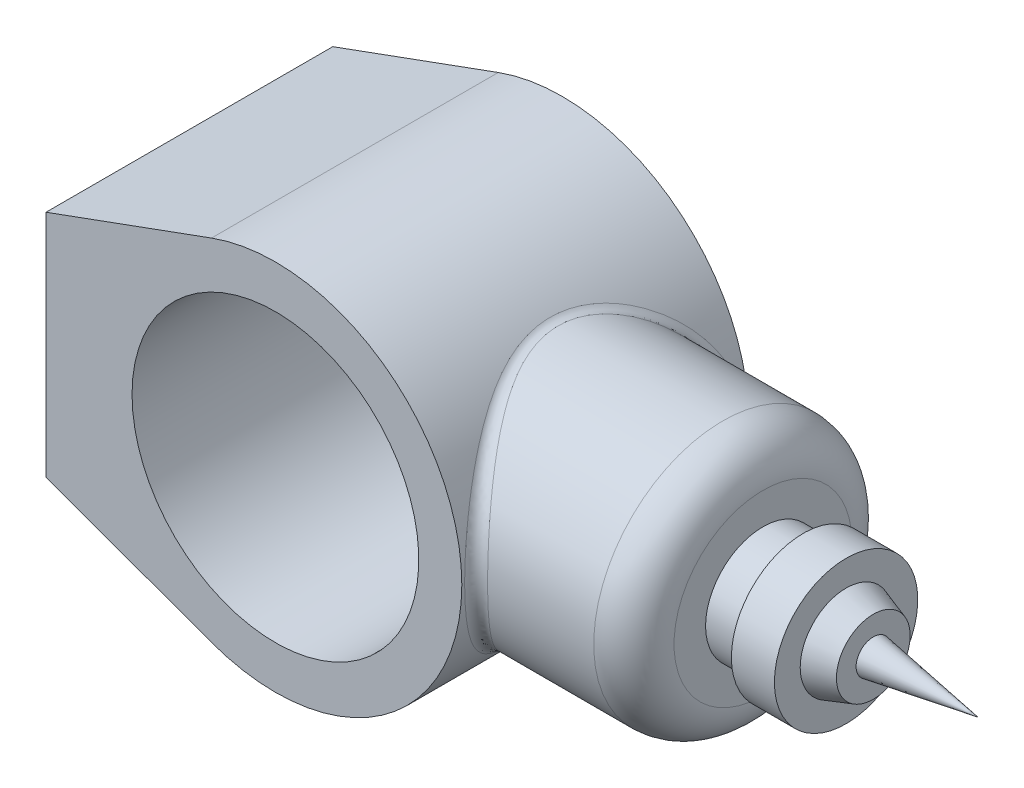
ISO-10303-21;
HEADER;
FILE_DESCRIPTION(('STEP AP214'),'2;1');
FILE_NAME('part.step','',(''),(''),'','','');
FILE_SCHEMA(('AUTOMOTIVE_DESIGN { 1 0 10303 214 1 1 1 1 }'));
ENDSEC;
DATA;
#1=APPLICATION_CONTEXT('core data for automotive mechanical design processes');
#2=APPLICATION_PROTOCOL_DEFINITION('international standard','automotive_design',2000,#1);
#3=PRODUCT_CONTEXT('',#1,'mechanical');
#4=PRODUCT('Part','Part','',(#3));
#5=PRODUCT_RELATED_PRODUCT_CATEGORY('part','',(#4));
#6=PRODUCT_DEFINITION_FORMATION('','',#4);
#7=PRODUCT_DEFINITION_CONTEXT('part definition',#1,'design');
#8=PRODUCT_DEFINITION('design','',#6,#7);
#9=PRODUCT_DEFINITION_SHAPE('','',#8);
#10=(LENGTH_UNIT() NAMED_UNIT(*) SI_UNIT(.MILLI.,.METRE.));
#11=(NAMED_UNIT(*) PLANE_ANGLE_UNIT() SI_UNIT($,.RADIAN.));
#12=(NAMED_UNIT(*) SI_UNIT($,.STERADIAN.) SOLID_ANGLE_UNIT());
#13=UNCERTAINTY_MEASURE_WITH_UNIT(LENGTH_MEASURE(1.E-05),#10,'distance_accuracy_value','');
#14=(GEOMETRIC_REPRESENTATION_CONTEXT(3) GLOBAL_UNCERTAINTY_ASSIGNED_CONTEXT((#13)) GLOBAL_UNIT_ASSIGNED_CONTEXT((#10,
#11,#12)) REPRESENTATION_CONTEXT('',''));
#15=CARTESIAN_POINT('',(0.,0.,0.));
#16=DIRECTION('',(0.,0.,1.));
#17=DIRECTION('',(1.,0.,0.));
#18=AXIS2_PLACEMENT_3D('',#15,#16,#17);
#19=CARTESIAN_POINT('',(0.,0.,50.));
#20=DIRECTION('',(0.,0.,1.));
#21=DIRECTION('',(1.,0.,0.));
#22=AXIS2_PLACEMENT_3D('',#19,#20,#21);
#23=PLANE('',#22);
#24=DIRECTION('',(-0.939410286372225,-0.342794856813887,0.));
#25=VECTOR('',#24,1.);
#26=CARTESIAN_POINT('',(-80.,40.,50.));
#27=LINE('',#26,#25);
#28=CARTESIAN_POINT('',(-22.2816656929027,61.0616686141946,50.));
#29=VERTEX_POINT('',#28);
#30=CARTESIAN_POINT('',(-80.,40.,50.));
#31=VERTEX_POINT('',#30);
#32=EDGE_CURVE('E139',#29,#31,#27,.T.);
#33=ORIENTED_EDGE('',*,*,#32,.T.);
#34=DIRECTION('',(0.,-1.,0.));
#35=VECTOR('',#34,1.);
#36=CARTESIAN_POINT('',(-80.,-40.,50.));
#37=LINE('',#36,#35);
#38=CARTESIAN_POINT('',(-80.,-40.,50.));
#39=VERTEX_POINT('',#38);
#40=EDGE_CURVE('E89',#31,#39,#37,.T.);
#41=ORIENTED_EDGE('',*,*,#40,.T.);
#42=DIRECTION('',(0.939410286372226,-0.342794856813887,0.));
#43=VECTOR('',#42,1.);
#44=CARTESIAN_POINT('',(-80.,-40.,50.));
#45=LINE('',#44,#43);
#46=CARTESIAN_POINT('',(-22.2816656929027,-61.0616686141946,50.));
#47=VERTEX_POINT('',#46);
#48=EDGE_CURVE('E144',#39,#47,#45,.T.);
#49=ORIENTED_EDGE('',*,*,#48,.T.);
#50=CARTESIAN_POINT('',(0.,0.,50.));
#51=DIRECTION('',(0.,0.,1.));
#52=DIRECTION('',(1.,0.,0.));
#53=AXIS2_PLACEMENT_3D('',#50,#51,#52);
#54=CIRCLE('',#53,65.);
#55=EDGE_CURVE('E57',#47,#29,#54,.T.);
#56=ORIENTED_EDGE('',*,*,#55,.T.);
#57=EDGE_LOOP('',(#33,#41,#49,#56));
#58=FACE_BOUND('',#57,.T.);
#59=CARTESIAN_POINT('',(0.,0.,50.));
#60=DIRECTION('',(0.,0.,1.));
#61=DIRECTION('',(1.,0.,0.));
#62=AXIS2_PLACEMENT_3D('',#59,#60,#61);
#63=CIRCLE('',#62,50.);
#64=CARTESIAN_POINT('',(-50.,0.,50.));
#65=VERTEX_POINT('',#64);
#66=EDGE_CURVE('E131',#65,#65,#63,.T.);
#67=ORIENTED_EDGE('',*,*,#66,.F.);
#68=EDGE_LOOP('',(#67));
#69=FACE_BOUND('',#68,.T.);
#70=ADVANCED_FACE('F39',(#58,#69),#23,.T.);
#71=CARTESIAN_POINT('',(0.,0.,-50.));
#72=DIRECTION('',(0.,0.,1.));
#73=DIRECTION('',(1.,0.,0.));
#74=AXIS2_PLACEMENT_3D('',#71,#72,#73);
#75=PLANE('',#74);
#76=DIRECTION('',(-0.939410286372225,-0.342794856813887,0.));
#77=VECTOR('',#76,1.);
#78=CARTESIAN_POINT('',(-80.,40.,-50.));
#79=LINE('',#78,#77);
#80=CARTESIAN_POINT('',(-22.2816656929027,61.0616686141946,-50.));
#81=VERTEX_POINT('',#80);
#82=CARTESIAN_POINT('',(-80.,40.,-50.));
#83=VERTEX_POINT('',#82);
#84=EDGE_CURVE('E135',#81,#83,#79,.T.);
#85=ORIENTED_EDGE('',*,*,#84,.F.);
#86=CARTESIAN_POINT('',(0.,0.,-50.));
#87=DIRECTION('',(0.,0.,1.));
#88=DIRECTION('',(1.,0.,0.));
#89=AXIS2_PLACEMENT_3D('',#86,#87,#88);
#90=CIRCLE('',#89,65.);
#91=CARTESIAN_POINT('',(-22.2816656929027,-61.0616686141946,-50.));
#92=VERTEX_POINT('',#91);
#93=EDGE_CURVE('E81',#92,#81,#90,.T.);
#94=ORIENTED_EDGE('',*,*,#93,.F.);
#95=DIRECTION('',(0.939410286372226,-0.342794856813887,0.));
#96=VECTOR('',#95,1.);
#97=CARTESIAN_POINT('',(-80.,-40.,-50.));
#98=LINE('',#97,#96);
#99=CARTESIAN_POINT('',(-80.,-40.,-50.));
#100=VERTEX_POINT('',#99);
#101=EDGE_CURVE('E75',#100,#92,#98,.T.);
#102=ORIENTED_EDGE('',*,*,#101,.F.);
#103=DIRECTION('',(0.,-1.,0.));
#104=VECTOR('',#103,1.);
#105=CARTESIAN_POINT('',(-80.,-40.,-50.));
#106=LINE('',#105,#104);
#107=EDGE_CURVE('E153',#83,#100,#106,.T.);
#108=ORIENTED_EDGE('',*,*,#107,.F.);
#109=EDGE_LOOP('',(#85,#94,#102,#108));
#110=FACE_BOUND('',#109,.T.);
#111=CARTESIAN_POINT('',(0.,0.,-50.));
#112=DIRECTION('',(0.,0.,1.));
#113=DIRECTION('',(1.,0.,0.));
#114=AXIS2_PLACEMENT_3D('',#111,#112,#113);
#115=CIRCLE('',#114,50.);
#116=CARTESIAN_POINT('',(-50.,0.,-50.));
#117=VERTEX_POINT('',#116);
#118=EDGE_CURVE('E130',#117,#117,#115,.T.);
#119=ORIENTED_EDGE('',*,*,#118,.T.);
#120=EDGE_LOOP('',(#119));
#121=FACE_BOUND('',#120,.T.);
#122=ADVANCED_FACE('F238',(#110,#121),#75,.F.);
#123=CARTESIAN_POINT('',(-80.,40.,50.));
#124=DIRECTION('',(0.342794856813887,-0.939410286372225,0.));
#125=DIRECTION('',(0.939410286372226,0.342794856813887,0.));
#126=AXIS2_PLACEMENT_3D('',#123,#124,#125);
#127=PLANE('',#126);
#128=ORIENTED_EDGE('',*,*,#84,.T.);
#129=DIRECTION('',(0.,0.,-1.));
#130=VECTOR('',#129,1.);
#131=CARTESIAN_POINT('',(-80.,40.,50.));
#132=LINE('',#131,#130);
#133=EDGE_CURVE('E168',#31,#83,#132,.T.);
#134=ORIENTED_EDGE('',*,*,#133,.F.);
#135=ORIENTED_EDGE('',*,*,#32,.F.);
#136=DIRECTION('',(0.,0.,-1.));
#137=VECTOR('',#136,1.);
#138=CARTESIAN_POINT('',(-22.2816656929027,61.0616686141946,50.));
#139=LINE('',#138,#137);
#140=EDGE_CURVE('E149',#29,#81,#139,.T.);
#141=ORIENTED_EDGE('',*,*,#140,.T.);
#142=EDGE_LOOP('',(#128,#134,#135,#141));
#143=FACE_BOUND('',#142,.T.);
#144=ADVANCED_FACE('F194',(#143),#127,.F.);
#145=CARTESIAN_POINT('',(-80.,-40.,50.));
#146=DIRECTION('',(1.,0.,0.));
#147=DIRECTION('',(0.,0.,-1.));
#148=AXIS2_PLACEMENT_3D('',#145,#146,#147);
#149=PLANE('',#148);
#150=ORIENTED_EDGE('',*,*,#107,.T.);
#151=DIRECTION('',(0.,0.,-1.));
#152=VECTOR('',#151,1.);
#153=CARTESIAN_POINT('',(-80.,-40.,50.));
#154=LINE('',#153,#152);
#155=EDGE_CURVE('E165',#39,#100,#154,.T.);
#156=ORIENTED_EDGE('',*,*,#155,.F.);
#157=ORIENTED_EDGE('',*,*,#40,.F.);
#158=ORIENTED_EDGE('',*,*,#133,.T.);
#159=EDGE_LOOP('',(#150,#156,#157,#158));
#160=FACE_BOUND('',#159,.T.);
#161=ADVANCED_FACE('F253',(#160),#149,.F.);
#162=CARTESIAN_POINT('',(-80.,-40.,50.));
#163=DIRECTION('',(0.342794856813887,0.939410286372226,0.));
#164=DIRECTION('',(-0.939410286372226,0.342794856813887,0.));
#165=AXIS2_PLACEMENT_3D('',#162,#163,#164);
#166=PLANE('',#165);
#167=ORIENTED_EDGE('',*,*,#101,.T.);
#168=DIRECTION('',(0.,0.,-1.));
#169=VECTOR('',#168,1.);
#170=CARTESIAN_POINT('',(-22.2816656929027,-61.0616686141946,50.));
#171=LINE('',#170,#169);
#172=EDGE_CURVE('E162',#47,#92,#171,.T.);
#173=ORIENTED_EDGE('',*,*,#172,.F.);
#174=ORIENTED_EDGE('',*,*,#48,.F.);
#175=ORIENTED_EDGE('',*,*,#155,.T.);
#176=EDGE_LOOP('',(#167,#173,#174,#175));
#177=FACE_BOUND('',#176,.T.);
#178=ADVANCED_FACE('F255',(#177),#166,.F.);
#179=CARTESIAN_POINT('',(0.,0.,50.));
#180=DIRECTION('',(0.,0.,-1.));
#181=DIRECTION('',(-1.,0.,0.));
#182=AXIS2_PLACEMENT_3D('',#179,#180,#181);
#183=CYLINDRICAL_SURFACE('',#182,65.);
#184=CARTESIAN_POINT('',(66.9351788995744,-15.3859239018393,-42.2879811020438));
#185=CARTESIAN_POINT('',(63.3523184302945,-14.5939853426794,-42.5761174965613));
#186=CARTESIAN_POINT('',(63.0548786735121,-15.7823406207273,-46.0469127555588));
#187=CARTESIAN_POINT('',(67.2025894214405,-14.4047409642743,-42.6449670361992));
#188=CARTESIAN_POINT('',(63.5714595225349,-13.6375306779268,-42.9032044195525));
#189=CARTESIAN_POINT('',(63.3067871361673,-14.775877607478,-46.4356307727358));
#190=CARTESIAN_POINT('',(67.4474674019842,-13.4063896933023,-42.9695074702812));
#191=CARTESIAN_POINT('',(63.7691474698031,-12.6751877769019,-43.1962965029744));
#192=CARTESIAN_POINT('',(63.5374692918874,-13.7518039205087,-46.7890192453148));
#193=CARTESIAN_POINT('',(67.8872964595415,-11.3810525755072,-43.5497545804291));
#194=CARTESIAN_POINT('',(64.1226132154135,-10.7320548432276,-43.7182423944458));
#195=CARTESIAN_POINT('',(63.9518010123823,-11.6742842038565,-47.4208438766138));
#196=CARTESIAN_POINT('',(68.0822584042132,-10.3540730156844,-43.8054762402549));
#197=CARTESIAN_POINT('',(64.2777438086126,-9.75278272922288,-43.9461212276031));
#198=CARTESIAN_POINT('',(64.1354608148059,-10.6208446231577,-47.6992963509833));
#199=CARTESIAN_POINT('',(68.4182179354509,-8.27814885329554,-44.2447384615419));
#200=CARTESIAN_POINT('',(64.544268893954,-7.78046804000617,-44.3365570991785));
#201=CARTESIAN_POINT('',(64.4519444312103,-8.49143449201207,-48.1776041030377));
#202=CARTESIAN_POINT('',(68.5592526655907,-7.22921989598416,-44.4283287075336));
#203=CARTESIAN_POINT('',(64.6551379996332,-6.78931478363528,-44.4983370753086));
#204=CARTESIAN_POINT('',(64.5848032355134,-7.41547998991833,-48.3775134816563));
#205=CARTESIAN_POINT('',(68.7844825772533,-5.11585061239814,-44.7209799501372));
#206=CARTESIAN_POINT('',(64.8320203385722,-4.79673139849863,-44.7560373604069));
#207=CARTESIAN_POINT('',(64.79697634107,-5.24765996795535,-48.6961781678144));
#208=CARTESIAN_POINT('',(68.8686759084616,-4.05140978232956,-44.8300385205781));
#209=CARTESIAN_POINT('',(64.8976308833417,-3.79748392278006,-44.8513686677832));
#210=CARTESIAN_POINT('',(64.8762888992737,-4.15579393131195,-48.8149308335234));
#211=CARTESIAN_POINT('',(68.9784499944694,-1.91231586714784,-44.9721551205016));
#212=CARTESIAN_POINT('',(64.9832929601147,-1.79036679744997,-44.975776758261));
#213=CARTESIAN_POINT('',(64.979699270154,-1.96158648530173,-48.9696800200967));
#214=CARTESIAN_POINT('',(69.003888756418,-0.837644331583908,-45.0050290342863));
#215=CARTESIAN_POINT('',(65.0030289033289,-0.784875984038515,-45.0043947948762));
#216=CARTESIAN_POINT('',(65.00366332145,-0.85922615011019,-49.0054760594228));
#217=CARTESIAN_POINT('',(68.9951483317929,1.31108271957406,-44.9937257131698));
#218=CARTESIAN_POINT('',(64.9962218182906,1.22825092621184,-44.9945180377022));
#219=CARTESIAN_POINT('',(64.9954295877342,1.34486262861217,-48.9931679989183));
#220=CARTESIAN_POINT('',(68.9609693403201,2.38513823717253,-44.9495487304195));
#221=CARTESIAN_POINT('',(64.9696954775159,2.23343553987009,-44.9560474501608));
#222=CARTESIAN_POINT('',(64.963231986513,2.44659107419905,-48.9450641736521));
#223=CARTESIAN_POINT('',(68.8337700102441,4.52461080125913,-44.7848112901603));
#224=CARTESIAN_POINT('',(64.8703690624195,4.24192878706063,-44.8117478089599));
#225=CARTESIAN_POINT('',(64.8434065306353,4.64118692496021,-48.7656834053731));
#226=CARTESIAN_POINT('',(68.740737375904,5.59002599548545,-44.6642348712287));
#227=CARTESIAN_POINT('',(64.7977959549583,5.24286547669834,-44.7062488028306));
#228=CARTESIAN_POINT('',(64.7557670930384,5.73405243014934,-48.6343890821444));
#229=CARTESIAN_POINT('',(68.4979176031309,7.70416466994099,-44.3484860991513));
#230=CARTESIAN_POINT('',(64.6068517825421,7.23813681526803,-44.4278755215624));
#231=CARTESIAN_POINT('',(64.5270238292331,7.90266166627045,-48.2905737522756));
#232=CARTESIAN_POINT('',(68.3481307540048,8.75288823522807,-44.1533141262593));
#233=CARTESIAN_POINT('',(64.4889118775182,8.23031031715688,-44.2556327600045));
#234=CARTESIAN_POINT('',(64.3859202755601,8.97840548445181,-48.0780531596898));
#235=CARTESIAN_POINT('',(68.0005881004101,10.7940624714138,-43.6983666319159));
#236=CARTESIAN_POINT('',(64.2126656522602,10.1724820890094,-43.8505304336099));
#237=CARTESIAN_POINT('',(64.0585250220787,11.0721703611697,-47.5826658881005));
#238=CARTESIAN_POINT('',(67.804481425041,11.787246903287,-43.4408056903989));
#239=CARTESIAN_POINT('',(64.0563026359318,11.1209208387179,-43.6205734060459));
#240=CARTESIAN_POINT('',(63.8737868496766,12.0909440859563,-47.3022106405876));
#241=CARTESIAN_POINT('',(67.3658458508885,13.7457210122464,-42.8613817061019));
#242=CARTESIAN_POINT('',(63.7031881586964,13.0023508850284,-43.0985367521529));
#243=CARTESIAN_POINT('',(63.4605794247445,14.0998780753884,-46.6712823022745));
#244=CARTESIAN_POINT('',(67.1233182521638,14.7110114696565,-42.5395204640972));
#245=CARTESIAN_POINT('',(63.5070451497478,13.9340031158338,-42.8073765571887));
#246=CARTESIAN_POINT('',(63.2321113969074,15.0900391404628,-46.3208111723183));
#247=CARTESIAN_POINT('',(66.5961861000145,16.6091412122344,-41.8349308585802));
#248=CARTESIAN_POINT('',(63.0765515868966,15.7772864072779,-42.164095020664));
#249=CARTESIAN_POINT('',(62.7355376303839,17.037073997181,-45.5535913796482));
#250=CARTESIAN_POINT('',(66.3115785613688,17.5419781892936,-41.4521981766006));
#251=CARTESIAN_POINT('',(62.8428339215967,16.6879399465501,-41.8129558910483));
#252=CARTESIAN_POINT('',(62.4674290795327,17.993945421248,-45.1368380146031));
#253=CARTESIAN_POINT('',(65.7050640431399,19.3714323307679,-40.6294692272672));
#254=CARTESIAN_POINT('',(62.3400253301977,18.4846513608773,-41.051339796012));
#255=CARTESIAN_POINT('',(61.8960748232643,19.8705352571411,-44.2409776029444));
#256=CARTESIAN_POINT('',(65.3831548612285,20.2680473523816,-40.1894695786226));
#257=CARTESIAN_POINT('',(62.0715473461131,19.3700903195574,-40.6418511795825));
#258=CARTESIAN_POINT('',(61.5928270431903,20.7902514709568,-43.7618668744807));
#259=CARTESIAN_POINT('',(64.6711685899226,22.1152224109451,-39.2061824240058));
#260=CARTESIAN_POINT('',(61.4727631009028,21.2035055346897,-39.7195099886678));
#261=CARTESIAN_POINT('',(60.9221153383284,22.6850188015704,-42.6911764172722));
#262=CARTESIAN_POINT('',(64.2774826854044,23.0614120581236,-38.656889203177));
#263=CARTESIAN_POINT('',(61.1392385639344,22.1489875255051,-39.2009085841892));
#264=CARTESIAN_POINT('',(60.5512518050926,23.6555869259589,-42.0930571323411));
#265=CARTESIAN_POINT('',(63.4576046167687,24.9029325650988,-37.4970446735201));
#266=CARTESIAN_POINT('',(60.4383015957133,23.9995102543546,-38.0963149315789));
#267=CARTESIAN_POINT('',(59.7789028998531,25.5445540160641,-40.8301153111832));
#268=CARTESIAN_POINT('',(63.0314105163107,25.7982603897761,-36.8864897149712));
#269=CARTESIAN_POINT('',(60.0714980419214,24.9045887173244,-37.5114593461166));
#270=CARTESIAN_POINT('',(59.3774157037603,26.4629498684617,-40.1652888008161));
#271=CARTESIAN_POINT('',(62.1532848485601,27.5366065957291,-35.6075925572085));
#272=CARTESIAN_POINT('',(59.3096664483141,26.6704466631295,-36.2769340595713));
#273=CARTESIAN_POINT('',(58.550195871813,28.2460843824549,-38.772711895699));
#274=CARTESIAN_POINT('',(61.7013324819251,28.3795815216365,-34.9392034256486));
#275=CARTESIAN_POINT('',(58.915054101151,27.5315842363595,-35.6281677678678));
#276=CARTESIAN_POINT('',(58.124443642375,29.110778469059,-38.0449103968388));
#277=CARTESIAN_POINT('',(60.7792763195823,30.010821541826,-33.5484657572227));
#278=CARTESIAN_POINT('',(58.1044073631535,29.2048419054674,-34.2691948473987));
#279=CARTESIAN_POINT('',(57.255840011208,30.7840472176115,-36.5305516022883));
#280=CARTESIAN_POINT('',(60.3091716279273,30.799083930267,-32.8261145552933));
#281=CARTESIAN_POINT('',(57.6886291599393,30.017612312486,-33.5597405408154));
#282=CARTESIAN_POINT('',(56.8129877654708,31.592619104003,-35.7439914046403));
#283=CARTESIAN_POINT('',(59.2715030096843,32.4583124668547,-31.1937237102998));
#284=CARTESIAN_POINT('',(56.7665092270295,31.7323106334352,-31.9490514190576));
#285=CARTESIAN_POINT('',(55.8354738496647,33.2945974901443,-33.96649915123));
#286=CARTESIAN_POINT('',(58.7018018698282,33.3181410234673,-30.2734812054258));
#287=CARTESIAN_POINT('',(56.2563511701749,32.6270480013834,-31.0350945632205));
#288=CARTESIAN_POINT('',(55.2987988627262,34.1765794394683,-32.9644573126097));
#289=CARTESIAN_POINT('',(57.5603493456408,34.9574666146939,-28.36474354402));
#290=CARTESIAN_POINT('',(55.228487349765,34.3379041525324,-29.1286002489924));
#291=CARTESIAN_POINT('',(54.2235174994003,35.858142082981,-30.8860540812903));
#292=CARTESIAN_POINT('',(56.9885975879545,35.7369481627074,-27.3762352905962));
#293=CARTESIAN_POINT('',(54.7105468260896,35.1556497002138,-28.1365027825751));
#294=CARTESIAN_POINT('',(53.6849107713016,36.6577068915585,-29.8096784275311));
#295=CARTESIAN_POINT('',(55.8571699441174,37.2130621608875,-25.3333083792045));
#296=CARTESIAN_POINT('',(53.6812322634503,36.707381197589,-26.0768543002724));
#297=CARTESIAN_POINT('',(52.6190731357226,38.1718528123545,-27.5851580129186));
#298=CARTESIAN_POINT('',(55.297496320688,37.9096791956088,-24.2788775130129));
#299=CARTESIAN_POINT('',(53.1693069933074,37.4431238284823,-25.0093105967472));
#300=CARTESIAN_POINT('',(52.0918443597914,38.8864181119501,-26.4369999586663));
#301=CARTESIAN_POINT('',(54.2062711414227,39.216366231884,-22.1061752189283));
#302=CARTESIAN_POINT('',(52.1680792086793,38.8249512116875,-22.8017962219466));
#303=CARTESIAN_POINT('',(51.0638786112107,40.2267718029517,-24.0711685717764));
#304=CARTESIAN_POINT('',(53.6747124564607,39.8264582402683,-20.9879201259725));
#305=CARTESIAN_POINT('',(51.6779453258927,39.4728689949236,-21.6614275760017));
#306=CARTESIAN_POINT('',(50.5631349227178,40.8525827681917,-22.8535130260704));
#307=CARTESIAN_POINT('',(52.7640492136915,40.8374505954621,-18.9295630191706));
#308=CARTESIAN_POINT('',(50.8356788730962,40.5482843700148,-19.5546598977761));
#309=CARTESIAN_POINT('',(49.705263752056,41.8896232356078,-20.6121908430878));
#310=CARTESIAN_POINT('',(52.3762962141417,41.2554255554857,-18.0010546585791));
#311=CARTESIAN_POINT('',(50.4762258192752,40.9936543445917,-18.6029608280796));
#312=CARTESIAN_POINT('',(49.3399891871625,42.3183672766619,-19.6011484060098));
#313=CARTESIAN_POINT('',(51.6397153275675,42.031274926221,-16.1065034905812));
#314=CARTESIAN_POINT('',(49.7926058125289,41.8206078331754,-16.6579749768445));
#315=CARTESIAN_POINT('',(48.6461086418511,43.1142063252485,-17.5381926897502));
#316=CARTESIAN_POINT('',(51.2908853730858,42.3891525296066,-15.1404626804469));
#317=CARTESIAN_POINT('',(49.4678612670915,42.2030388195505,-15.6640458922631));
#318=CARTESIAN_POINT('',(48.3175007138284,43.4813046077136,-16.4862815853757));
#319=CARTESIAN_POINT('',(50.6435977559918,43.040541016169,-13.1750359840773));
#320=CARTESIAN_POINT('',(48.8648926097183,42.8990756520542,-13.6395554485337));
#321=CARTESIAN_POINT('',(47.7077370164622,44.1494760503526,-14.3461502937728));
#322=CARTESIAN_POINT('',(50.3450494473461,43.3341680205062,-12.175714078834));
#323=CARTESIAN_POINT('',(48.5859936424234,43.2135772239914,-12.6082161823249));
#324=CARTESIAN_POINT('',(47.4264958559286,44.4506683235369,-13.2579997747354));
#325=CARTESIAN_POINT('',(49.8087395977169,43.8537655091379,-10.146119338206));
#326=CARTESIAN_POINT('',(48.0849495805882,43.7698741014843,-10.5121312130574));
#327=CARTESIAN_POINT('',(46.9212764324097,44.9836531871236,-11.0479966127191));
#328=CARTESIAN_POINT('',(49.5709667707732,44.0797485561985,-9.11585228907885));
#329=CARTESIAN_POINT('',(47.862228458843,44.0123567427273,-9.4463108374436));
#330=CARTESIAN_POINT('',(46.6972875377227,45.2154586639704,-9.92615027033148));
#331=CARTESIAN_POINT('',(49.1973218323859,44.4311752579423,-7.1888145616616));
#332=CARTESIAN_POINT('',(47.5122968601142,44.3892567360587,-7.45172555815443));
#333=CARTESIAN_POINT('',(46.3453031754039,45.5759398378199,-7.82782030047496));
#334=CARTESIAN_POINT('',(49.0514623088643,44.5666711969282,-6.29550740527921));
#335=CARTESIAN_POINT('',(47.3754810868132,44.5347601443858,-6.52628783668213));
#336=CARTESIAN_POINT('',(46.2078992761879,45.7149268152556,-6.85510806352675));
#337=CARTESIAN_POINT('',(48.8162257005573,44.7839854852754,-4.49616301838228));
#338=CARTESIAN_POINT('',(47.1549528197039,44.7679592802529,-4.66221683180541));
#339=CARTESIAN_POINT('',(45.9862995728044,45.9378401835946,-4.89582195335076));
#340=CARTESIAN_POINT('',(48.7268423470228,44.8658097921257,-3.59012721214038));
#341=CARTESIAN_POINT('',(47.0710203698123,44.8558910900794,-3.72269922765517));
#342=CARTESIAN_POINT('',(45.9020978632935,46.0217726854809,-3.90924963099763));
#343=CARTESIAN_POINT('',(48.6080978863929,44.9743151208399,-1.77195782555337));
#344=CARTESIAN_POINT('',(46.9596155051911,44.9723871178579,-1.83784026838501));
#345=CARTESIAN_POINT('',(45.7902371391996,46.1330736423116,-1.92946518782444));
#346=CARTESIAN_POINT('',(48.5787014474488,45.0010286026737,-0.859828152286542));
#347=CARTESIAN_POINT('',(46.9319970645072,45.0011045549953,-0.891554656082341));
#348=CARTESIAN_POINT('',(45.7625448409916,46.1604753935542,-0.93625732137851));
#349=CARTESIAN_POINT('',(48.581027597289,44.998910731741,0.964326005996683));
#350=CARTESIAN_POINT('',(46.9341800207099,44.9988302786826,0.999928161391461));
#351=CARTESIAN_POINT('',(45.7647361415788,46.1583029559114,1.05004387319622));
#352=CARTESIAN_POINT('',(48.6127517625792,44.9700779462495,1.87635048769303));
#353=CARTESIAN_POINT('',(46.9639851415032,44.9678346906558,1.9460956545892));
#354=CARTESIAN_POINT('',(45.7946212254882,46.1287272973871,2.04313719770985));
#355=CARTESIAN_POINT('',(48.7359127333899,44.8575045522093,3.69190101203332));
#356=CARTESIAN_POINT('',(47.0795309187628,44.8469730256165,3.82820477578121));
#357=CARTESIAN_POINT('',(45.9106424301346,46.0132534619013,4.02006999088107));
#358=CARTESIAN_POINT('',(48.8272434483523,44.7738614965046,4.59543926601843));
#359=CARTESIAN_POINT('',(47.1652887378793,44.7570892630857,4.76510570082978));
#360=CARTESIAN_POINT('',(45.9966786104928,45.9274553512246,5.00392275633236));
#361=CARTESIAN_POINT('',(49.0659452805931,44.553231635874,6.38957017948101));
#362=CARTESIAN_POINT('',(47.3890578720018,44.520337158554,6.62371215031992));
#363=CARTESIAN_POINT('',(46.2215426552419,45.7011409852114,6.95753197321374));
#364=CARTESIAN_POINT('',(49.2133161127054,44.4162451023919,7.28016290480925));
#365=CARTESIAN_POINT('',(47.5272847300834,44.3732373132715,7.54629479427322));
#366=CARTESIAN_POINT('',(46.3603702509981,45.5606250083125,7.92728849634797));
#367=CARTESIAN_POINT('',(49.5590346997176,44.0908461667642,9.04450543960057));
#368=CARTESIAN_POINT('',(47.8509580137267,44.0243590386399,9.37192109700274));
#369=CARTESIAN_POINT('',(46.6860471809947,45.2268422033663,9.84846147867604));
#370=CARTESIAN_POINT('',(49.7574452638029,43.90237038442,9.91823306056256));
#371=CARTESIAN_POINT('',(48.0367539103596,43.82218785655,10.2757213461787));
#372=CARTESIAN_POINT('',(46.8729556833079,45.0335103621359,10.7998537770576));
#373=CARTESIAN_POINT('',(50.1988265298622,43.4765243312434,11.643973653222));
#374=CARTESIAN_POINT('',(48.4492424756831,43.3661685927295,12.0584970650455));
#375=CARTESIAN_POINT('',(47.2887496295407,44.5966924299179,12.6789935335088));
#376=CARTESIAN_POINT('',(50.4418034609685,43.2391472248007,12.495983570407));
#377=CARTESIAN_POINT('',(48.6762799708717,43.1119130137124,12.9381433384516));
#378=CARTESIAN_POINT('',(47.5176409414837,44.3531993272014,13.6067376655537));
#379=CARTESIAN_POINT('',(51.0693864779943,42.6147010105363,14.5084227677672));
#380=CARTESIAN_POINT('',(49.2619581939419,42.4436351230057,15.0146415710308));
#381=CARTESIAN_POINT('',(48.1088423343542,43.7126643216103,15.7980603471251));
#382=CARTESIAN_POINT('',(51.4719685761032,42.2055832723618,15.6573307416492));
#383=CARTESIAN_POINT('',(49.637181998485,42.0060240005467,16.1976879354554));
#384=CARTESIAN_POINT('',(48.4880863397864,43.2930057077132,17.0490934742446));
#385=CARTESIAN_POINT('',(52.3328859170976,41.3030103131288,17.9032830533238));
#386=CARTESIAN_POINT('',(50.4365091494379,41.0437427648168,18.5042604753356));
#387=CARTESIAN_POINT('',(49.2990954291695,42.3671780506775,19.4946859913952));
#388=CARTESIAN_POINT('',(52.7912427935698,40.8095223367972,19.0003070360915));
#389=CARTESIAN_POINT('',(50.8615846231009,40.5176577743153,19.6288533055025));
#390=CARTESIAN_POINT('',(49.7308808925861,41.8609754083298,20.6892232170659));
#391=CARTESIAN_POINT('',(53.7477904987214,39.7425208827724,21.1415456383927));
#392=CARTESIAN_POINT('',(51.7449951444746,39.3841886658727,21.8173260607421));
#393=CARTESIAN_POINT('',(50.6319765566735,40.7664827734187,23.0207941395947));
#394=CARTESIAN_POINT('',(54.2460398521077,39.1688888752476,22.1856788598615));
#395=CARTESIAN_POINT('',(52.2042200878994,38.775229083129,22.8818037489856));
#396=CARTESIAN_POINT('',(51.1013418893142,40.1780711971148,24.1577392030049));
#397=CARTESIAN_POINT('',(55.2669804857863,37.9460753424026,24.2177940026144));
#398=CARTESIAN_POINT('',(53.1409314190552,37.4821255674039,24.9464174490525));
#399=CARTESIAN_POINT('',(52.0630975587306,38.9237520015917,26.3704868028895));
#400=CARTESIAN_POINT('',(55.789669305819,37.2969014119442,25.2057815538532));
#401=CARTESIAN_POINT('',(53.6190939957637,36.7965040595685,25.9469050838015));
#402=CARTESIAN_POINT('',(52.5554855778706,38.2578521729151,27.4462954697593));
#403=CARTESIAN_POINT('',(56.8600182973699,35.9082585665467,27.1488310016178));
#404=CARTESIAN_POINT('',(54.5935451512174,35.3359173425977,27.9071738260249));
#405=CARTESIAN_POINT('',(53.5637853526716,36.833431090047,29.5620604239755));
#406=CARTESIAN_POINT('',(57.4079753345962,35.1669083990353,28.1024096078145));
#407=CARTESIAN_POINT('',(55.0903294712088,34.5577990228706,28.8649609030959));
#408=CARTESIAN_POINT('',(54.0799767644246,36.0729801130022,30.6004015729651));
#409=CARTESIAN_POINT('',(58.5033973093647,33.6098772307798,29.9471705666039));
#410=CARTESIAN_POINT('',(56.0778641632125,32.93151490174,30.7094615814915));
#411=CARTESIAN_POINT('',(55.1118960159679,34.4758321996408,32.6091412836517));
#412=CARTESIAN_POINT('',(59.0508622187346,32.7941922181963,30.8383495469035));
#413=CARTESIAN_POINT('',(56.5688487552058,32.0818828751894,31.5958047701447));
#414=CARTESIAN_POINT('',(55.6276238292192,33.6391311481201,33.5795361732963));
#415=CARTESIAN_POINT('',(60.1334513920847,31.0907791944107,32.5549500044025));
#416=CARTESIAN_POINT('',(57.5337517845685,30.3171755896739,33.2943714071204));
#417=CARTESIAN_POINT('',(56.6474542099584,31.8918298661,35.4487233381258));
#418=CARTESIAN_POINT('',(60.6685811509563,30.2030840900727,33.3804011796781));
#419=CARTESIAN_POINT('',(58.0076220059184,29.4008558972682,34.1059022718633));
#420=CARTESIAN_POINT('',(57.1515619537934,30.9812633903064,36.347547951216));
#421=CARTESIAN_POINT('',(61.715776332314,28.357285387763,34.961995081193));
#422=CARTESIAN_POINT('',(58.9287017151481,27.5068941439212,35.6520103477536));
#423=CARTESIAN_POINT('',(58.1380501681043,29.0879078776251,38.0697279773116));
#424=CARTESIAN_POINT('',(62.2278440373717,27.3991887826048,35.718144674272));
#425=CARTESIAN_POINT('',(59.3755477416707,26.528293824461,36.3855045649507));
#426=CARTESIAN_POINT('',(58.6204327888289,28.10512601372,38.8930908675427));
#427=CARTESIAN_POINT('',(63.1853356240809,25.4810747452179,37.1082544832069));
#428=CARTESIAN_POINT('',(60.2046819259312,24.5827530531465,37.72502428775));
#429=CARTESIAN_POINT('',(59.5224176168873,26.1375919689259,40.4067659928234));
#430=CARTESIAN_POINT('',(63.6329266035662,24.5254409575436,37.7469995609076));
#431=CARTESIAN_POINT('',(60.5891025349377,23.618053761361,38.3356955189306));
#432=CARTESIAN_POINT('',(59.9440612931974,25.1573363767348,41.1022884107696));
#433=CARTESIAN_POINT('',(64.490417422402,22.5574241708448,38.9550461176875));
#434=CARTESIAN_POINT('',(61.3204093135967,21.6439850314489,39.4836138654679));
#435=CARTESIAN_POINT('',(60.7518424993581,23.138613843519,42.4177168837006));
#436=CARTESIAN_POINT('',(64.9003147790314,21.5450374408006,39.5243430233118));
#437=CARTESIAN_POINT('',(61.6665365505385,20.6346413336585,40.0194686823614));
#438=CARTESIAN_POINT('',(61.1379776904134,22.1001430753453,43.0376179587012));
#439=CARTESIAN_POINT('',(65.6733247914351,19.4693413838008,40.5869591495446));
#440=CARTESIAN_POINT('',(62.3147037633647,18.5786929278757,41.0135290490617));
#441=CARTESIAN_POINT('',(61.8661755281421,19.9709669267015,44.1946888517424));
#442=CARTESIAN_POINT('',(66.0365282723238,18.4061366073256,41.0804262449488));
#443=CARTESIAN_POINT('',(62.6159211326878,17.5327225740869,41.4703611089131));
#444=CARTESIAN_POINT('',(62.2083237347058,18.8803687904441,44.732019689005));
#445=CARTESIAN_POINT('',(66.7090176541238,16.232508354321,41.9868012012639));
#446=CARTESIAN_POINT('',(63.169987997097,15.4078745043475,42.3046351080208));
#447=CARTESIAN_POINT('',(62.8418282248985,16.6507372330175,45.7189613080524));
#448=CARTESIAN_POINT('',(67.0183264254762,15.1221051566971,42.3997432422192));
#449=CARTESIAN_POINT('',(63.42185324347,14.3302271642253,42.6805186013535));
#450=CARTESIAN_POINT('',(63.1332060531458,15.5117246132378,46.1686093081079));
#451=CARTESIAN_POINT('',(67.5963814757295,12.7770566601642,43.1668645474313));
#452=CARTESIAN_POINT('',(63.8901411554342,12.0665424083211,43.3757130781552));
#453=CARTESIAN_POINT('',(63.6777506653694,13.1062561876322,47.0039191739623));
#454=CARTESIAN_POINT('',(67.8604719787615,11.5392798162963,43.5144891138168));
#455=CARTESIAN_POINT('',(64.1012097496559,10.8815637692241,43.686724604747));
#456=CARTESIAN_POINT('',(63.9265315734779,11.8365881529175,47.3824437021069));
#457=CARTESIAN_POINT('',(68.310430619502,9.02651653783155,44.1042761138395));
#458=CARTESIAN_POINT('',(64.4595438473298,8.48735908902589,44.2128129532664));
#459=CARTESIAN_POINT('',(64.3504056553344,9.25908379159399,48.0246562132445));
#460=CARTESIAN_POINT('',(68.496276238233,7.75151950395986,44.3464081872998));
#461=CARTESIAN_POINT('',(64.6057141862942,7.28135039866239,44.4262613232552));
#462=CARTESIAN_POINT('',(64.525477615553,7.95123659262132,48.288311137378));
#463=CARTESIAN_POINT('',(68.7573197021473,5.41406118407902,44.6857440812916));
#464=CARTESIAN_POINT('',(64.8107627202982,5.07728854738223,44.7251109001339));
#465=CARTESIAN_POINT('',(64.771388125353,5.55355390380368,48.6578102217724));
#466=CARTESIAN_POINT('',(68.8465675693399,4.35555567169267,44.8013943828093));
#467=CARTESIAN_POINT('',(64.8803644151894,4.08312690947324,44.8262753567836));
#468=CARTESIAN_POINT('',(64.8554622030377,4.46777610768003,48.78374055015));
#469=CARTESIAN_POINT('',(68.9670000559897,2.22988606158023,44.9573486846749));
#470=CARTESIAN_POINT('',(64.9743870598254,2.08796808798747,44.9628556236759));
#471=CARTESIAN_POINT('',(64.968913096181,2.2873388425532,48.9535574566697));
#472=CARTESIAN_POINT('',(68.9981702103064,1.16271987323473,44.9976339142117));
#473=CARTESIAN_POINT('',(64.9985754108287,1.08929980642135,44.9979332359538));
#474=CARTESIAN_POINT('',(64.9982762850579,1.19267722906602,48.9974235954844));
#475=CARTESIAN_POINT('',(69.001674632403,-0.972672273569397,45.0021654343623));
#476=CARTESIAN_POINT('',(65.0013038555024,-0.911320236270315,45.0018915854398));
#477=CARTESIAN_POINT('',(65.001577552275,-0.997733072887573,49.0023579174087));
#478=CARTESIAN_POINT('',(68.9739630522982,-2.0408984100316,44.9663524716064));
#479=CARTESIAN_POINT('',(64.9798018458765,-1.91086561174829,44.9707112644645));
#480=CARTESIAN_POINT('',(64.975472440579,-2.09348194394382,48.9633615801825));
#481=CARTESIAN_POINT('',(68.8602519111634,-4.16940997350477,44.8191255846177));
#482=CARTESIAN_POINT('',(64.8910534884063,-3.90829765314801,44.8418109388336));
#483=CARTESIAN_POINT('',(64.8683532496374,-4.27683438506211,48.8030478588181));
#484=CARTESIAN_POINT('',(68.7742557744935,-5.22969586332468,44.7077161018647));
#485=CARTESIAN_POINT('',(64.8240195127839,-4.90384000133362,44.744399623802));
#486=CARTESIAN_POINT('',(64.7873423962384,-5.36443842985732,48.6817353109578));
#487=CARTESIAN_POINT('',(68.5461969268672,-7.33192049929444,44.4113379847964));
#488=CARTESIAN_POINT('',(64.6448620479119,-6.88636506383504,44.48334535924));
#489=CARTESIAN_POINT('',(64.5725043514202,-7.52082666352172,48.3590124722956));
#490=CARTESIAN_POINT('',(68.4042791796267,-8.37389946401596,44.2265595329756));
#491=CARTESIAN_POINT('',(64.5332566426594,-7.87121407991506,44.3204610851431));
#492=CARTESIAN_POINT('',(64.4388137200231,-8.58965210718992,48.157809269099));
#493=CARTESIAN_POINT('',(68.0674110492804,-10.4353257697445,43.7860136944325));
#494=CARTESIAN_POINT('',(64.2659205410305,-9.83025663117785,43.9287621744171));
#495=CARTESIAN_POINT('',(64.1214741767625,-10.7041908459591,47.6781038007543));
#496=CARTESIAN_POINT('',(67.8724597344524,-11.4547727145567,43.5302450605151));
#497=CARTESIAN_POINT('',(64.1107385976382,-10.8026100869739,43.7007599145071));
#498=CARTESIAN_POINT('',(63.9378243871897,-11.7499037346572,47.3996001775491));
#499=CARTESIAN_POINT('',(67.4334623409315,-13.4651121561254,42.950962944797));
#500=CARTESIAN_POINT('',(63.7578346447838,-12.7317910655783,43.179535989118));
#501=CARTESIAN_POINT('',(63.5242761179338,-13.8120393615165,46.7688263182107));
#502=CARTESIAN_POINT('',(67.1894122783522,-14.4560023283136,42.6274439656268));
#503=CARTESIAN_POINT('',(63.5607538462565,-13.6871422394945,42.8872809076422));
#504=CARTESIAN_POINT('',(63.2943738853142,-14.828459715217,46.4165500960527));
#505=CARTESIAN_POINT('',(66.656859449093,-16.4040860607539,41.9163609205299));
#506=CARTESIAN_POINT('',(63.1263520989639,-15.5772389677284,42.2387857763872));
#507=CARTESIAN_POINT('',(62.7926936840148,-16.8267356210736,45.6422596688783));
#508=CARTESIAN_POINT('',(66.3683554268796,-17.3612786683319,41.5287950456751));
#509=CARTESIAN_POINT('',(62.8897110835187,-16.51090557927,41.8835983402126));
#510=CARTESIAN_POINT('',(62.520914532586,-17.8085901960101,45.2202434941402));
#511=CARTESIAN_POINT('',(65.739559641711,-19.275715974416,40.6766326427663));
#512=CARTESIAN_POINT('',(62.3689878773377,-18.3894715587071,41.0955272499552));
#513=CARTESIAN_POINT('',(61.9285706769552,-19.7723527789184,44.2923333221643));
#514=CARTESIAN_POINT('',(65.3976493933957,-20.231408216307,40.2095612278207));
#515=CARTESIAN_POINT('',(62.0839918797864,-19.3329761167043,40.6610875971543));
#516=CARTESIAN_POINT('',(61.6064813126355,-20.7526683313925,43.7837444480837));
#517=CARTESIAN_POINT('',(64.6772864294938,-22.0983641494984,39.2145558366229));
#518=CARTESIAN_POINT('',(61.4777400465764,-21.1872680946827,39.7271081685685));
#519=CARTESIAN_POINT('',(60.9278785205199,-22.6677261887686,42.7002941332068));
#520=CARTESIAN_POINT('',(64.2988329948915,-23.0096269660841,38.6866206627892));
#521=CARTESIAN_POINT('',(61.1571515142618,-22.0977110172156,39.2287055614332));
#522=CARTESIAN_POINT('',(60.5713644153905,-23.602467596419,42.1254313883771));
#523=CARTESIAN_POINT('',(63.5114903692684,-24.7853830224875,37.5737033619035));
#524=CARTESIAN_POINT('',(60.4843464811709,-23.8815261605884,38.1692638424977));
#525=CARTESIAN_POINT('',(59.8296648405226,-25.4239758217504,40.9135881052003));
#526=CARTESIAN_POINT('',(63.1025912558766,-25.6498608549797,36.9887026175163));
#527=CARTESIAN_POINT('',(60.1326682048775,-24.754913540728,37.6092252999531));
#528=CARTESIAN_POINT('',(59.4444700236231,-26.3107268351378,40.2765872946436));
#529=CARTESIAN_POINT('',(62.2607870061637,-27.3298542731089,35.7653335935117));
#530=CARTESIAN_POINT('',(59.4030484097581,-26.4602966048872,36.4293407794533));
#531=CARTESIAN_POINT('',(58.6514660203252,-28.0340051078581,38.9444743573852));
#532=CARTESIAN_POINT('',(61.8278790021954,-28.1453639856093,35.1269589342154));
#533=CARTESIAN_POINT('',(59.0255079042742,-27.2926142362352,35.8103556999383));
#534=CARTESIAN_POINT('',(58.2436541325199,-28.8705263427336,38.2493552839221));
#535=CARTESIAN_POINT('',(60.8669136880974,-29.8647589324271,33.6833492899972));
#536=CARTESIAN_POINT('',(58.1826768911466,-29.0526884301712,34.4029524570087));
#537=CARTESIAN_POINT('',(57.3383969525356,-30.6342213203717,36.6774247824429));
#538=CARTESIAN_POINT('',(60.3354997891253,-30.7590067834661,32.868500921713));
#539=CARTESIAN_POINT('',(57.7129151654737,-29.9746175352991,33.6031125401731));
#540=CARTESIAN_POINT('',(56.8377896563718,-31.5515093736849,35.7901454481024));
#541=CARTESIAN_POINT('',(59.2591903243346,-32.4758375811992,31.173317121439));
#542=CARTESIAN_POINT('',(56.7551183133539,-31.7512086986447,31.9281504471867));
#543=CARTESIAN_POINT('',(55.823874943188,-33.3125741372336,33.9442786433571));
#544=CARTESIAN_POINT('',(58.7142928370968,-33.2984102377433,30.2929723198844));
#545=CARTESIAN_POINT('',(56.2671758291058,-32.6070909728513,31.0537864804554));
#546=CARTESIAN_POINT('',(55.3105657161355,-34.1563402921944,32.9856809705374));
#547=CARTESIAN_POINT('',(57.6219664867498,-34.8706485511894,28.469085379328));
#548=CARTESIAN_POINT('',(55.2837908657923,-34.2476419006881,29.2324562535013));
#549=CARTESIAN_POINT('',(54.2815626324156,-35.7690871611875,30.9996707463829));
#550=CARTESIAN_POINT('',(57.0745358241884,-35.6202497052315,27.52548855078));
#551=CARTESIAN_POINT('',(54.7881396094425,-35.0336907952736,28.2858269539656));
#552=CARTESIAN_POINT('',(53.7658670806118,-36.5380017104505,29.9721986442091));
#553=CARTESIAN_POINT('',(55.9900148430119,-37.0434876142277,25.5780073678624));
#554=CARTESIAN_POINT('',(53.8020946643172,-36.5291977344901,26.3234857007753));
#555=CARTESIAN_POINT('',(52.7442168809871,-37.9979091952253,27.8516080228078));
#556=CARTESIAN_POINT('',(55.4529234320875,-37.71713243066,24.5741294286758));
#557=CARTESIAN_POINT('',(53.3112348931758,-37.2402100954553,25.3078285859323));
#558=CARTESIAN_POINT('',(52.238261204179,-38.6889103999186,26.758496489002));
#559=CARTESIAN_POINT('',(54.4488403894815,-38.9300069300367,22.5981858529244));
#560=CARTESIAN_POINT('',(52.3902927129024,-38.5227081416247,23.3007904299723));
#561=CARTESIAN_POINT('',(51.292385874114,-39.9330344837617,24.6069134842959));
#562=CARTESIAN_POINT('',(53.9798302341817,-39.4758424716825,21.6310412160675));
#563=CARTESIAN_POINT('',(51.958506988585,-39.1016527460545,22.3157228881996));
#564=CARTESIAN_POINT('',(50.8505647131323,-40.4929334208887,23.5538004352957));
#565=CARTESIAN_POINT('',(53.0735809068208,-40.4989648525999,19.6488593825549));
#566=CARTESIAN_POINT('',(51.1224537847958,-40.1876960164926,20.2918022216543));
#567=CARTESIAN_POINT('',(49.9968515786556,-41.5424164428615,21.3954246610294));
#568=CARTESIAN_POINT('',(52.6363429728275,-40.976249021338,18.633820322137));
#569=CARTESIAN_POINT('',(50.7175189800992,-40.6959890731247,19.2524260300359));
#570=CARTESIAN_POINT('',(49.5849607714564,-42.0319977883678,20.2901599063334));
#571=CARTESIAN_POINT('',(51.8075414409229,-41.8576094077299,16.5592457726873));
#572=CARTESIAN_POINT('',(49.9489205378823,-41.6349006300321,17.1241504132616));
#573=CARTESIAN_POINT('',(48.8042057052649,-42.9360663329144,18.031178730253));
#574=CARTESIAN_POINT('',(51.4159055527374,-42.2618020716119,15.4997844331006));
#575=CARTESIAN_POINT('',(49.5844354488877,-42.0667819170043,16.0345346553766));
#576=CARTESIAN_POINT('',(48.4352733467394,-43.3506729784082,16.8775430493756));
#577=CARTESIAN_POINT('',(50.6920206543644,-42.9930211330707,13.3379533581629));
#578=CARTESIAN_POINT('',(48.910317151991,-42.8479600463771,13.8083288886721));
#579=CARTESIAN_POINT('',(47.753352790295,-44.1007318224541,14.5235492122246));
#580=CARTESIAN_POINT('',(50.359754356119,-43.3200700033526,12.2355962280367));
#581=CARTESIAN_POINT('',(48.5998693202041,-43.1983325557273,12.6706277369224));
#582=CARTESIAN_POINT('',(47.4403483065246,-44.4362070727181,13.3232047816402));
#583=CARTESIAN_POINT('',(49.8329003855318,-43.830235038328,10.2340703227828));
#584=CARTESIAN_POINT('',(48.1073610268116,-43.7448588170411,10.6023157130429));
#585=CARTESIAN_POINT('',(46.9440365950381,-44.9595164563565,11.1437654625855));
#586=CARTESIAN_POINT('',(49.6240691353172,-44.0291777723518,9.34208301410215));
#587=CARTESIAN_POINT('',(47.9118410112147,-43.9582342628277,9.67978535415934));
#588=CARTESIAN_POINT('',(46.7473115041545,-45.1635849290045,10.1724903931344));
#589=CARTESIAN_POINT('',(49.2590838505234,-44.3735044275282,7.5388464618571));
#590=CARTESIAN_POINT('',(47.5701866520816,-44.3273633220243,7.81419035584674));
#591=CARTESIAN_POINT('',(46.4034847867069,-45.5167831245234,8.20896614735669));
#592=CARTESIAN_POINT('',(49.1029228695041,-44.5188954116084,6.62759977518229));
#593=CARTESIAN_POINT('',(47.423725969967,-44.483483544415,6.87029827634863));
#594=CARTESIAN_POINT('',(46.2563766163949,-45.6659200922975,7.21671975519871));
#595=CARTESIAN_POINT('',(48.8492372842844,-44.7536587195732,4.79216731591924));
#596=CARTESIAN_POINT('',(47.1859306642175,-44.7353881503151,4.96905079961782));
#597=CARTESIAN_POINT('',(46.0173974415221,-45.9067320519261,5.21813774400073));
#598=CARTESIAN_POINT('',(48.7516417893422,-44.8430987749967,3.86799857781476));
#599=CARTESIAN_POINT('',(47.0942904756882,-44.8315027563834,4.01078139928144));
#600=CARTESIAN_POINT('',(45.9254596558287,-45.9984765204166,4.2118206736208));
#601=CARTESIAN_POINT('',(48.6187601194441,-44.9646109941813,2.01207506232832));
#602=CARTESIAN_POINT('',(46.9696287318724,-44.9619587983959,2.08687004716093));
#603=CARTESIAN_POINT('',(45.8002812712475,-46.1231194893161,2.19092617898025));
#604=CARTESIAN_POINT('',(48.583474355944,-44.9966827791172,1.08032023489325));
#605=CARTESIAN_POINT('',(46.9364761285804,-44.9964378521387,1.12022102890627));
#606=CARTESIAN_POINT('',(45.7670410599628,-46.1560176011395,1.17634870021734));
#607=CARTESIAN_POINT('',(48.5767194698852,-45.0028333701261,-0.785200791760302));
#608=CARTESIAN_POINT('',(46.930137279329,-45.0030423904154,-0.814153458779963));
#609=CARTESIAN_POINT('',(45.7606777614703,-46.1623266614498,-0.854996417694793));
#610=CARTESIAN_POINT('',(48.6053614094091,-44.9768112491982,-1.7189676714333));
#611=CARTESIAN_POINT('',(46.9570485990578,-44.975066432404,-1.78291769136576));
#612=CARTESIAN_POINT('',(45.7876592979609,-46.1356340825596,-1.87176479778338));
#613=CARTESIAN_POINT('',(48.725455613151,-44.8670811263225,-3.57961731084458));
#614=CARTESIAN_POINT('',(47.0697201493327,-44.857255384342,-3.7118252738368));
#615=CARTESIAN_POINT('',(45.9007915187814,-46.0230767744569,-3.89780551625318));
#616=CARTESIAN_POINT('',(48.8169074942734,-44.783373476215,-4.50650011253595));
#617=CARTESIAN_POINT('',(47.1555996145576,-44.7672952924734,-4.67298621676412));
#618=CARTESIAN_POINT('',(45.9869418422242,-45.9372124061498,-4.90707790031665));
#619=CARTESIAN_POINT('',(49.0590170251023,-44.5596737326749,-6.34798822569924));
#620=CARTESIAN_POINT('',(47.3825689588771,-44.5272444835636,-6.58069546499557));
#621=CARTESIAN_POINT('',(46.2150160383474,-45.7077490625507,-6.91225384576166));
#622=CARTESIAN_POINT('',(49.2097501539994,-44.4196098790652,-7.26257634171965));
#623=CARTESIAN_POINT('',(47.5239600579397,-44.3768293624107,-7.52817191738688));
#624=CARTESIAN_POINT('',(46.3570110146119,-45.564076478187,-7.90813868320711));
#625=CARTESIAN_POINT('',(49.5647188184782,-44.0854876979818,-9.07289741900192));
#626=CARTESIAN_POINT('',(47.8562920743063,-44.0186010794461,-9.40137101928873));
#627=CARTESIAN_POINT('',(46.6914017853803,-45.2213456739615,-9.87937718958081));
#628=CARTESIAN_POINT('',(49.7689614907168,-43.891422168,-9.96862784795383));
#629=CARTESIAN_POINT('',(48.0475545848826,-43.8104284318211,-10.3279374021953));
#630=CARTESIAN_POINT('',(46.8838043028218,-45.0222800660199,-10.8547281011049));
#631=CARTESIAN_POINT('',(50.2869899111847,-43.3912409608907,-11.981312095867));
#632=CARTESIAN_POINT('',(48.5319137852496,-43.2745235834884,-12.4081688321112));
#633=CARTESIAN_POINT('',(47.3718020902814,-44.5092117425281,-13.0463176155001));
#634=CARTESIAN_POINT('',(50.6154510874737,-43.0689824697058,-13.0910843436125));
#635=CARTESIAN_POINT('',(48.8388897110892,-42.9292188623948,-13.5537917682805));
#636=CARTESIAN_POINT('',(47.6812220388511,-44.1786502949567,-14.2547362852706));
#637=CARTESIAN_POINT('',(51.3333043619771,-42.3463460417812,-15.2677177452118));
#638=CARTESIAN_POINT('',(49.5075720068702,-42.15706865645,-15.7957895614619));
#639=CARTESIAN_POINT('',(48.3574606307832,-43.4373952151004,-16.6248482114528));
#640=CARTESIAN_POINT('',(51.7227150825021,-41.9459442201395,-16.3345656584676));
#641=CARTESIAN_POINT('',(49.8701038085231,-41.7291424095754,-16.8933126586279));
#642=CARTESIAN_POINT('',(48.7242968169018,-43.0266770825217,-17.7865270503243));
#643=CARTESIAN_POINT('',(52.5482214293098,-41.0714761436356,-18.4232811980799));
#644=CARTESIAN_POINT('',(50.6358939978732,-40.7973686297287,-19.0367214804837));
#645=CARTESIAN_POINT('',(49.5019477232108,-42.129678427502,-20.0609061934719));
#646=CARTESIAN_POINT('',(52.9843723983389,-40.5973222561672,-19.4450934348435));
#647=CARTESIAN_POINT('',(51.0399735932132,-40.2922788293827,-20.0833788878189));
#648=CARTESIAN_POINT('',(49.912814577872,-41.6433080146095,-21.1735461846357));
#649=CARTESIAN_POINT('',(53.8895008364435,-39.5797511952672,-21.4405628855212));
#650=CARTESIAN_POINT('',(51.8753065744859,-39.2118481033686,-22.1215620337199));
#651=CARTESIAN_POINT('',(50.7654718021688,-40.5995193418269,-23.3463906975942));
#652=CARTESIAN_POINT('',(54.3584763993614,-39.0363380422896,-22.41422289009));
#653=CARTESIAN_POINT('',(52.3072416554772,-38.6353033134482,-23.1136366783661));
#654=CARTESIAN_POINT('',(51.2072603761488,-40.0421052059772,-24.4065982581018));
#655=CARTESIAN_POINT('',(55.329490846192,-37.868635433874,-24.3364546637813));
#656=CARTESIAN_POINT('',(53.197914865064,-37.4006514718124,-25.0661721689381));
#657=CARTESIAN_POINT('',(52.1219841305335,-38.844316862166,-26.4996950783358));
#658=CARTESIAN_POINT('',(55.8320671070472,-37.2426415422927,-25.2837599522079));
#659=CARTESIAN_POINT('',(53.6575213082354,-36.7397080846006,-26.0252139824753));
#660=CARTESIAN_POINT('',(52.595425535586,-38.2021943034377,-27.5312052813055));
#661=CARTESIAN_POINT('',(56.8476598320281,-35.9235134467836,-27.1253400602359));
#662=CARTESIAN_POINT('',(54.5818711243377,-35.3525684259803,-27.8826272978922));
#663=CARTESIAN_POINT('',(53.5521433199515,-36.8490790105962,-29.5364813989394));
#664=CARTESIAN_POINT('',(57.360676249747,-35.2303795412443,-28.0196151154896));
#665=CARTESIAN_POINT('',(55.0470252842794,-34.6250853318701,-28.7809972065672));
#666=CARTESIAN_POINT('',(54.0354196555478,-36.1380865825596,-30.5102475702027));
#667=CARTESIAN_POINT('',(58.3870028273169,-33.778524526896,-29.7538317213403));
#668=CARTESIAN_POINT('',(55.9727474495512,-33.1080984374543,-30.5157864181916));
#669=CARTESIAN_POINT('',(55.0022490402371,-34.6488246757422,-32.3986167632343));
#670=CARTESIAN_POINT('',(58.9003130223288,-33.0197771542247,-30.5937512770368));
#671=CARTESIAN_POINT('',(56.4335164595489,-32.31736383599,-31.3518907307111));
#672=CARTESIAN_POINT('',(55.4858021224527,-33.8705282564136,-33.313195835));
#673=CARTESIAN_POINT('',(59.9174660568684,-31.438459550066,-32.2165641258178));
#674=CARTESIAN_POINT('',(57.341350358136,-30.677515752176,-32.9596833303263));
#675=CARTESIAN_POINT('',(56.4439897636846,-32.2484681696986,-35.0802587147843));
#676=CARTESIAN_POINT('',(60.4213078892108,-30.6158825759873,-32.9994513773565));
#677=CARTESIAN_POINT('',(57.7883924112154,-29.827330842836,-33.7307938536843));
#678=CARTESIAN_POINT('',(56.9186233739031,-31.4046975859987,-35.9327359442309));
#679=CARTESIAN_POINT('',(61.5120895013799,-28.7329142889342,-34.6598041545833));
#680=CARTESIAN_POINT('',(58.7514944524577,-27.8890820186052,-35.3598102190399));
#681=CARTESIAN_POINT('',(57.9461712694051,-29.4732148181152,-37.7406756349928));
#682=CARTESIAN_POINT('',(62.0948384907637,-27.6583817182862,-35.5236622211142));
#683=CARTESIAN_POINT('',(59.2608355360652,-26.7899256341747,-36.1989052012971));
#684=CARTESIAN_POINT('',(58.4951377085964,-28.3709970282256,-38.6813210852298));
#685=CARTESIAN_POINT('',(63.2180495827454,-25.4219804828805,-37.1569758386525));
#686=CARTESIAN_POINT('',(60.2346735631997,-24.5191876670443,-37.77462737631));
#687=CARTESIAN_POINT('',(59.5532351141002,-26.0769751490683,-40.4598181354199));
#688=CARTESIAN_POINT('',(63.7585031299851,-24.2600942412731,-37.9264123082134));
#689=CARTESIAN_POINT('',(60.6982058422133,-23.346814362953,-38.5091798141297));
#690=CARTESIAN_POINT('',(60.0623580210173,-24.8851530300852,-41.2976489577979));
#691=CARTESIAN_POINT('',(64.7814223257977,-21.8551857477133,-39.361238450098));
#692=CARTESIAN_POINT('',(61.5682485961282,-20.9393698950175,-39.8692125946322));
#693=CARTESIAN_POINT('',(61.025977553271,-22.4182823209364,-42.8600152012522));
#694=CARTESIAN_POINT('',(65.2639660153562,-20.6122762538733,-40.0267685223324));
#695=CARTESIAN_POINT('',(61.9734530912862,-19.7045499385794,-40.4923474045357));
#696=CARTESIAN_POINT('',(61.4805476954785,-21.1433493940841,-43.584703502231));
#697=CARTESIAN_POINT('',(65.9336660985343,-18.6925061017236,-40.9401113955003));
#698=CARTESIAN_POINT('',(62.5292330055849,-17.8194442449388,-41.3384121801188));
#699=CARTESIAN_POINT('',(62.1114245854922,-19.1741165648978,-44.579232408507));
#700=CARTESIAN_POINT('',(66.1478590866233,-18.0434248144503,-41.2303723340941));
#701=CARTESIAN_POINT('',(62.7065487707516,-17.182325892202,-41.6067311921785));
#702=CARTESIAN_POINT('',(62.3132005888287,-18.5083117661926,-44.8952943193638));
#703=CARTESIAN_POINT('',(66.5566510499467,-16.7275807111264,-41.7815375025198));
#704=CARTESIAN_POINT('',(63.0434590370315,-15.8956989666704,-42.1141994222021));
#705=CARTESIAN_POINT('',(62.698294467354,-17.1585650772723,-45.4954519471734));
#706=CARTESIAN_POINT('',(66.7512452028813,-16.060813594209,-42.0424345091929));
#707=CARTESIAN_POINT('',(63.2028254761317,-15.246456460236,-42.3529864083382));
#708=CARTESIAN_POINT('',(62.8816077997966,-16.474618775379,-45.7795397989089));
#709=CARTESIAN_POINT('',(66.9351788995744,-15.3859239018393,-42.2879811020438));
#710=CARTESIAN_POINT('',(63.3523184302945,-14.5939853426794,-42.5761174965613));
#711=CARTESIAN_POINT('',(63.0548786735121,-15.7823406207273,-46.0469127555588));
#712=(BOUNDED_SURFACE() B_SPLINE_SURFACE(3,2,((#184,#185,#186),(#187,#188,#189),(#190,#191,
#192),(#193,#194,#195),(#196,#197,#198),(#199,#200,#201),(#202,#203,#204),(#205,#206,#207),
(#208,#209,#210),(#211,#212,#213),(#214,#215,#216),(#217,#218,#219),(#220,#221,#222),(#223,#224,
#225),(#226,#227,#228),(#229,#230,#231),(#232,#233,#234),(#235,#236,#237),(#238,#239,#240),
(#241,#242,#243),(#244,#245,#246),(#247,#248,#249),(#250,#251,#252),(#253,#254,#255),(#256,#257,
#258),(#259,#260,#261),(#262,#263,#264),(#265,#266,#267),(#268,#269,#270),(#271,#272,#273),
(#274,#275,#276),(#277,#278,#279),(#280,#281,#282),(#283,#284,#285),(#286,#287,#288),(#289,#290,
#291),(#292,#293,#294),(#295,#296,#297),(#298,#299,#300),(#301,#302,#303),(#304,#305,#306),
(#307,#308,#309),(#310,#311,#312),(#313,#314,#315),(#316,#317,#318),(#319,#320,#321),(#322,#323,
#324),(#325,#326,#327),(#328,#329,#330),(#331,#332,#333),(#334,#335,#336),(#337,#338,#339),
(#340,#341,#342),(#343,#344,#345),(#346,#347,#348),(#349,#350,#351),(#352,#353,#354),(#355,#356,
#357),(#358,#359,#360),(#361,#362,#363),(#364,#365,#366),(#367,#368,#369),(#370,#371,#372),
(#373,#374,#375),(#376,#377,#378),(#379,#380,#381),(#382,#383,#384),(#385,#386,#387),(#388,#389,
#390),(#391,#392,#393),(#394,#395,#396),(#397,#398,#399),(#400,#401,#402),(#403,#404,#405),
(#406,#407,#408),(#409,#410,#411),(#412,#413,#414),(#415,#416,#417),(#418,#419,#420),(#421,#422,
#423),(#424,#425,#426),(#427,#428,#429),(#430,#431,#432),(#433,#434,#435),(#436,#437,#438),
(#439,#440,#441),(#442,#443,#444),(#445,#446,#447),(#448,#449,#450),(#451,#452,#453),(#454,#455,
#456),(#457,#458,#459),(#460,#461,#462),(#463,#464,#465),(#466,#467,#468),(#469,#470,#471),
(#472,#473,#474),(#475,#476,#477),(#478,#479,#480),(#481,#482,#483),(#484,#485,#486),(#487,#488,
#489),(#490,#491,#492),(#493,#494,#495),(#496,#497,#498),(#499,#500,#501),(#502,#503,#504),
(#505,#506,#507),(#508,#509,#510),(#511,#512,#513),(#514,#515,#516),(#517,#518,#519),(#520,#521,
#522),(#523,#524,#525),(#526,#527,#528),(#529,#530,#531),(#532,#533,#534),(#535,#536,#537),
(#538,#539,#540),(#541,#542,#543),(#544,#545,#546),(#547,#548,#549),(#550,#551,#552),(#553,#554,
#555),(#556,#557,#558),(#559,#560,#561),(#562,#563,#564),(#565,#566,#567),(#568,#569,#570),
(#571,#572,#573),(#574,#575,#576),(#577,#578,#579),(#580,#581,#582),(#583,#584,#585),(#586,#587,
#588),(#589,#590,#591),(#592,#593,#594),(#595,#596,#597),(#598,#599,#600),(#601,#602,#603),
(#604,#605,#606),(#607,#608,#609),(#610,#611,#612),(#613,#614,#615),(#616,#617,#618),(#619,#620,
#621),(#622,#623,#624),(#625,#626,#627),(#628,#629,#630),(#631,#632,#633),(#634,#635,#636),
(#637,#638,#639),(#640,#641,#642),(#643,#644,#645),(#646,#647,#648),(#649,#650,#651),(#652,#653,
#654),(#655,#656,#657),(#658,#659,#660),(#661,#662,#663),(#664,#665,#666),(#667,#668,#669),
(#670,#671,#672),(#673,#674,#675),(#676,#677,#678),(#679,#680,#681),(#682,#683,#684),(#685,#686,
#687),(#688,#689,#690),(#691,#692,#693),(#694,#695,#696),(#697,#698,#699),(#700,#701,#702),
(#703,#704,#705),(#706,#707,#708),(#709,#710,#711)),.UNSPECIFIED.,.T.,.F.,
.F.) B_SPLINE_SURFACE_WITH_KNOTS((4,2,2,2,2,2,2,2,2,2,2,2,2,2,2,2,2,2,2,2,2,2,2,2,2,2,2,2,2,2,2,
2,2,2,2,2,2,2,2,2,2,2,2,2,2,2,2,2,2,2,2,2,2,2,2,2,2,2,2,2,2,2,2,2,2,2,2,2,2,2,2,2,2,2,2,2,2,2,2,
2,2,2,2,2,2,2,2,4),(3,3),(0.,3.50315987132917,7.00555638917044,10.5055361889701,
14.0056299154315,17.5141735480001,21.0227056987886,24.5319710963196,28.0412186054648,
31.4405681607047,34.8398225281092,38.2393181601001,41.6390146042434,45.3994331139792,
49.1600757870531,52.923799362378,56.6877089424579,61.1381089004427,65.5893650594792,
70.0414480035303,74.4923965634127,78.0133870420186,81.5341904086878,85.0485770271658,
88.5623105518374,91.5429028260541,94.5231642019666,97.5016697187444,100.480252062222,
103.453547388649,106.42682758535,109.403784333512,112.381157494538,116.537948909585,
120.6963578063,124.860983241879,129.025190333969,133.295647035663,137.566334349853,
141.835080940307,146.103404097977,150.087258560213,154.071375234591,158.047621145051,
162.022175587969,166.289020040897,170.557091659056,174.041570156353,177.526916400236,
181.014977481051,184.502833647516,187.981707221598,191.460641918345,194.939859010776,
198.419174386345,202.038705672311,205.658308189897,209.279095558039,212.900316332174,
217.157598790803,221.415491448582,225.677114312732,229.938284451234,233.826050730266,
237.71396842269,241.595636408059,245.476172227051,248.523676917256,251.570779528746,
254.614186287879,257.657613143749,260.706331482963,263.755031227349,266.807625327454,
269.860626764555,273.756324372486,277.653214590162,281.55477099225,285.456101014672,
289.456580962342,293.457043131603,297.459114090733,301.461608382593,306.286293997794,
311.111953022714,315.931034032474,318.340030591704,320.749618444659),(0.,1.),
.UNSPECIFIED.) GEOMETRIC_REPRESENTATION_ITEM() RATIONAL_B_SPLINE_SURFACE(((1.,0.7358727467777,
1.),(1.,0.73227563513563,1.),(1.,0.728933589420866,1.),(1.,0.722870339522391,1.),(1.,
0.720149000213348,1.),(1.,0.715424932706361,1.),(1.,0.713421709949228,1.),(1.,0.710208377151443,
1.),(1.,0.708998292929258,1.),(1.,0.707418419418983,1.),(1.,0.707050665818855,1.),(1.,
0.707176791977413,1.),(1.,0.707670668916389,1.),(1.,0.709499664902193,1.),(1.,0.710834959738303,
1.),(1.,0.714292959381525,1.),(1.,0.716415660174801,1.),(1.,0.721289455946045,1.),(1.,
0.72401878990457,1.),(1.,0.730048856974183,1.),(1.,0.733349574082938,1.),(1.,0.740422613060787,
1.),(1.,0.744194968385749,1.),(1.,0.752108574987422,1.),(1.,0.756249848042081,1.),(1.,
0.765255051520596,1.),(1.,0.770149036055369,1.),(1.,0.780139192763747,1.),(1.,0.785235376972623,
1.),(1.,0.795519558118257,1.),(1.,0.800707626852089,1.),(1.,0.811069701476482,1.),(1.,
0.816243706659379,1.),(1.,0.827422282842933,1.),(1.,0.833406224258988,1.),(1.,0.845098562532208,
1.),(1.,0.850806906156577,1.),(1.,0.861831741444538,1.),(1.,0.867148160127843,1.),(1.,
0.87727825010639,1.),(1.,0.882092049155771,1.),(1.,0.890168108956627,1.),(1.,0.893544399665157,
1.),(1.,0.899862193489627,1.),(1.,0.902803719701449,1.),(1.,0.908191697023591,1.),(1.,
0.910639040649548,1.),(1.,0.914990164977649,1.),(1.,0.916894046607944,1.),(1.,0.919864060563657,
1.),(1.,0.921013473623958,1.),(1.,0.922859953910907,1.),(1.,0.923557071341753,1.),(1.,
0.924481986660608,1.),(1.,0.924710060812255,1.),(1.,0.924691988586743,1.),(1.,0.924445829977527,
1.),(1.,0.923486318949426,1.),(1.,0.922773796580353,1.),(1.,0.920899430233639,1.),(1.,
0.919737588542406,1.),(1.,0.916988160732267,1.),(1.,0.915400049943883,1.),(1.,0.911829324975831,
1.),(1.,0.909846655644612,1.),(1.,0.904662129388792,1.),(1.,0.901288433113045,1.),(1.,
0.893926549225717,1.),(1.,0.88993812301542,1.),(1.,0.881430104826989,1.),(1.,0.876909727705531,
1.),(1.,0.867430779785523,1.),(1.,0.862472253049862,1.),(1.,0.852074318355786,1.),(1.,
0.84662586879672,1.),(1.,0.835462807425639,1.),(1.,0.829748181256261,1.),(1.,0.818169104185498,
1.),(1.,0.812304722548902,1.),(1.,0.800553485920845,1.),(1.,0.7946666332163,1.),(1.,
0.783407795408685,1.),(1.,0.778027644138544,1.),(1.,0.767515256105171,1.),(1.,0.762383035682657,
1.),(1.,0.752529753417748,1.),(1.,0.747807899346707,1.),(1.,0.738928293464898,1.),(1.,
0.73477030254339,1.),(1.,0.726900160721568,1.),(1.,0.723243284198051,1.),(1.,0.716951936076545,
1.),(1.,0.714317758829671,1.),(1.,0.710597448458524,1.),(1.,0.709315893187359,1.),(1.,
0.707583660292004,1.),(1.,0.707133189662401,1.),(1.,0.707082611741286,1.),(1.,0.707483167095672,
1.),(1.,0.709119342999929,1.),(1.,0.71035491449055,1.),(1.,0.713607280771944,1.),(1.,
0.715622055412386,1.),(1.,0.72035655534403,1.),(1.,0.723076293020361,1.),(1.,0.729125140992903,
1.),(1.,0.732454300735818,1.),(1.,0.739615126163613,1.),(1.,0.743446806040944,1.),(1.,
0.751664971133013,1.),(1.,0.756067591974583,1.),(1.,0.765176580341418,1.),(1.,0.769882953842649,
1.),(1.,0.779487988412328,1.),(1.,0.784386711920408,1.),(1.,0.794272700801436,1.),(1.,
0.799259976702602,1.),(1.,0.810106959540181,1.),(1.,0.815966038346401,1.),(1.,0.827548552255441,
1.),(1.,0.83327196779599,1.),(1.,0.844473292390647,1.),(1.,0.849950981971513,1.),(1.,
0.860552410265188,1.),(1.,0.865676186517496,1.),(1.,0.875045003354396,1.),(1.,0.879327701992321,
1.),(1.,0.887448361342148,1.),(1.,0.89128630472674,1.),(1.,0.898439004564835,1.),(1.,
0.901754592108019,1.),(1.,0.907795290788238,1.),(1.,0.910520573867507,1.),(1.,0.914793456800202,
1.),(1.,0.91646828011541,1.),(1.,0.919375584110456,1.),(1.,0.920608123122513,1.),(1.,
0.922601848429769,1.),(1.,0.923363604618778,1.),(1.,0.924399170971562,1.),(1.,0.924672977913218,
1.),(1.,0.924725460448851,1.),(1.,0.924503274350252,1.),(1.,0.923567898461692,1.),(1.,
0.922854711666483,1.),(1.,0.920954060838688,1.),(1.,0.919765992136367,1.),(1.,0.916942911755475,
1.),(1.,0.915307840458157,1.),(1.,0.911114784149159,1.),(1.,0.908426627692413,1.),(1.,
0.902449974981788,1.),(1.,0.899161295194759,1.),(1.,0.892054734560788,1.),(1.,0.888236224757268,
1.),(1.,0.880146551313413,1.),(1.,0.875875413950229,1.),(1.,0.866838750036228,1.),(1.,
0.862063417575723,1.),(1.,0.852191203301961,1.),(1.,0.847094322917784,1.),(1.,0.836660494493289,
1.),(1.,0.831323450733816,1.),(1.,0.820503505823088,1.),(1.,0.815020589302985,1.),(1.,
0.802881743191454,1.),(1.,0.796216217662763,1.),(1.,0.783035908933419,1.),(1.,0.776521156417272,
1.),(1.,0.763897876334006,1.),(1.,0.757788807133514,1.),(1.,0.749135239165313,1.),(1.,
0.746336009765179,1.),(1.,0.740941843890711,1.),(1.,0.738346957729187,1.),(1.,0.7358727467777,1.))) REPRESENTATION_ITEM('') SURFACE());
#713=CARTESIAN_POINT('',(63.0548786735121,-15.7823406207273,-46.0469127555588));
#714=CARTESIAN_POINT('',(62.8816077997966,-16.474618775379,-45.7795397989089));
#715=CARTESIAN_POINT('',(62.698294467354,-17.1585650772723,-45.4954519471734));
#716=CARTESIAN_POINT('',(62.3132005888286,-18.5083117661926,-44.8952943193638));
#717=CARTESIAN_POINT('',(62.1114245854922,-19.1741165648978,-44.579232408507));
#718=CARTESIAN_POINT('',(61.4805476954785,-21.1433493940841,-43.5847035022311));
#719=CARTESIAN_POINT('',(61.025977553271,-22.4182823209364,-42.8600152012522));
#720=CARTESIAN_POINT('',(60.0623580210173,-24.8851530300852,-41.2976489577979));
#721=CARTESIAN_POINT('',(59.5532351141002,-26.0769751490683,-40.4598181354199));
#722=CARTESIAN_POINT('',(58.4951377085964,-28.3709970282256,-38.6813210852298));
#723=CARTESIAN_POINT('',(57.9461712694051,-29.4732148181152,-37.7406756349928));
#724=CARTESIAN_POINT('',(56.9186233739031,-31.4046975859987,-35.9327359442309));
#725=CARTESIAN_POINT('',(56.4439897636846,-32.2484681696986,-35.0802587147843));
#726=CARTESIAN_POINT('',(55.4858021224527,-33.8705282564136,-33.313195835));
#727=CARTESIAN_POINT('',(55.0022490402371,-34.6488246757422,-32.3986167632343));
#728=CARTESIAN_POINT('',(54.0354196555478,-36.1380865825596,-30.5102475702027));
#729=CARTESIAN_POINT('',(53.5521433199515,-36.8490790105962,-29.5364813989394));
#730=CARTESIAN_POINT('',(52.595425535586,-38.2021943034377,-27.5312052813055));
#731=CARTESIAN_POINT('',(52.1219841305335,-38.844316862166,-26.4996950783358));
#732=CARTESIAN_POINT('',(51.2072603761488,-40.0421052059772,-24.4065982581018));
#733=CARTESIAN_POINT('',(50.7654718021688,-40.5995193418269,-23.3463906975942));
#734=CARTESIAN_POINT('',(49.912814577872,-41.6433080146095,-21.1735461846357));
#735=CARTESIAN_POINT('',(49.5019477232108,-42.129678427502,-20.0609061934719));
#736=CARTESIAN_POINT('',(48.7242968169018,-43.0266770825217,-17.7865270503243));
#737=CARTESIAN_POINT('',(48.3574606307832,-43.4373952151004,-16.6248482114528));
#738=CARTESIAN_POINT('',(47.6812220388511,-44.1786502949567,-14.2547362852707));
#739=CARTESIAN_POINT('',(47.3718020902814,-44.5092117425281,-13.0463176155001));
#740=CARTESIAN_POINT('',(46.8838043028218,-45.0222800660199,-10.8547281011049));
#741=CARTESIAN_POINT('',(46.6914017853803,-45.2213456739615,-9.87937718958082));
#742=CARTESIAN_POINT('',(46.3570110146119,-45.564076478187,-7.9081386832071));
#743=CARTESIAN_POINT('',(46.2150160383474,-45.7077490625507,-6.91225384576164));
#744=CARTESIAN_POINT('',(45.9869418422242,-45.9372124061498,-4.90707790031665));
#745=CARTESIAN_POINT('',(45.9007915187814,-46.0230767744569,-3.89780551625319));
#746=CARTESIAN_POINT('',(45.7876592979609,-46.1356340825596,-1.87176479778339));
#747=CARTESIAN_POINT('',(45.7606777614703,-46.1623266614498,-0.854996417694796));
#748=CARTESIAN_POINT('',(45.7670410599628,-46.1560176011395,1.17634870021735));
#749=CARTESIAN_POINT('',(45.8002812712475,-46.1231194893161,2.19092617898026));
#750=CARTESIAN_POINT('',(45.9254596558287,-45.9984765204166,4.2118206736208));
#751=CARTESIAN_POINT('',(46.0173974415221,-45.9067320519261,5.21813774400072));
#752=CARTESIAN_POINT('',(46.2563766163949,-45.6659200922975,7.21671975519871));
#753=CARTESIAN_POINT('',(46.4034847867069,-45.5167831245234,8.20896614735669));
#754=CARTESIAN_POINT('',(46.7473115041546,-45.1635849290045,10.1724903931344));
#755=CARTESIAN_POINT('',(46.9440365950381,-44.9595164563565,11.1437654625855));
#756=CARTESIAN_POINT('',(47.4403483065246,-44.4362070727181,13.3232047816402));
#757=CARTESIAN_POINT('',(47.7533527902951,-44.1007318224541,14.5235492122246));
#758=CARTESIAN_POINT('',(48.4352733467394,-43.3506729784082,16.8775430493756));
#759=CARTESIAN_POINT('',(48.8042057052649,-42.9360663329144,18.031178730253));
#760=CARTESIAN_POINT('',(49.5849607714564,-42.0319977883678,20.2901599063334));
#761=CARTESIAN_POINT('',(49.9968515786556,-41.5424164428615,21.3954246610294));
#762=CARTESIAN_POINT('',(50.8505647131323,-40.4929334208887,23.5538004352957));
#763=CARTESIAN_POINT('',(51.292385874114,-39.9330344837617,24.6069134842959));
#764=CARTESIAN_POINT('',(52.238261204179,-38.6889103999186,26.758496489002));
#765=CARTESIAN_POINT('',(52.7442168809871,-37.9979091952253,27.8516080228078));
#766=CARTESIAN_POINT('',(53.7658670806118,-36.5380017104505,29.9721986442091));
#767=CARTESIAN_POINT('',(54.2815626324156,-35.7690871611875,30.9996707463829));
#768=CARTESIAN_POINT('',(55.3105657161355,-34.1563402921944,32.9856809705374));
#769=CARTESIAN_POINT('',(55.823874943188,-33.3125741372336,33.9442786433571));
#770=CARTESIAN_POINT('',(56.8377896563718,-31.5515093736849,35.7901454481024));
#771=CARTESIAN_POINT('',(57.3383969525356,-30.6342213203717,36.6774247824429));
#772=CARTESIAN_POINT('',(58.2436541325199,-28.8705263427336,38.2493552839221));
#773=CARTESIAN_POINT('',(58.6514660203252,-28.034005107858,38.9444743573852));
#774=CARTESIAN_POINT('',(59.4444700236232,-26.3107268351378,40.2765872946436));
#775=CARTESIAN_POINT('',(59.8296648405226,-25.4239758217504,40.9135881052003));
#776=CARTESIAN_POINT('',(60.5713644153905,-23.602467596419,42.1254313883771));
#777=CARTESIAN_POINT('',(60.9278785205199,-22.6677261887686,42.7002941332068));
#778=CARTESIAN_POINT('',(61.6064813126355,-20.7526683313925,43.7837444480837));
#779=CARTESIAN_POINT('',(61.9285706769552,-19.7723527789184,44.2923333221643));
#780=CARTESIAN_POINT('',(62.520914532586,-17.8085901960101,45.2202434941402));
#781=CARTESIAN_POINT('',(62.7926936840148,-16.8267356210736,45.6422596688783));
#782=CARTESIAN_POINT('',(63.2943738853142,-14.828459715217,46.4165500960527));
#783=CARTESIAN_POINT('',(63.5242761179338,-13.8120393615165,46.7688263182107));
#784=CARTESIAN_POINT('',(63.9378243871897,-11.7499037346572,47.3996001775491));
#785=CARTESIAN_POINT('',(64.1214741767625,-10.7041908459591,47.6781038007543));
#786=CARTESIAN_POINT('',(64.4388137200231,-8.58965210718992,48.157809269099));
#787=CARTESIAN_POINT('',(64.5725043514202,-7.52082666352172,48.3590124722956));
#788=CARTESIAN_POINT('',(64.7873423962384,-5.36443842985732,48.6817353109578));
#789=CARTESIAN_POINT('',(64.8683532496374,-4.27683438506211,48.8030478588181));
#790=CARTESIAN_POINT('',(64.975472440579,-2.09348194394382,48.9633615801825));
#791=CARTESIAN_POINT('',(65.001577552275,-0.997733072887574,49.0023579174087));
#792=CARTESIAN_POINT('',(64.9982762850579,1.19267722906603,48.9974235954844));
#793=CARTESIAN_POINT('',(64.968913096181,2.2873388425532,48.9535574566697));
#794=CARTESIAN_POINT('',(64.8554622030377,4.46777610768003,48.78374055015));
#795=CARTESIAN_POINT('',(64.771388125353,5.55355390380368,48.6578102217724));
#796=CARTESIAN_POINT('',(64.525477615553,7.95123659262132,48.288311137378));
#797=CARTESIAN_POINT('',(64.3504056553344,9.25908379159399,48.0246562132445));
#798=CARTESIAN_POINT('',(63.9265315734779,11.8365881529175,47.3824437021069));
#799=CARTESIAN_POINT('',(63.6777506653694,13.1062561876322,47.0039191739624));
#800=CARTESIAN_POINT('',(63.1332060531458,15.5117246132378,46.1686093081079));
#801=CARTESIAN_POINT('',(62.8418282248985,16.6507372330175,45.7189613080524));
#802=CARTESIAN_POINT('',(62.2083237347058,18.8803687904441,44.732019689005));
#803=CARTESIAN_POINT('',(61.8661755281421,19.9709669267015,44.1946888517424));
#804=CARTESIAN_POINT('',(61.1379776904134,22.1001430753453,43.0376179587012));
#805=CARTESIAN_POINT('',(60.7518424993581,23.138613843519,42.4177168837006));
#806=CARTESIAN_POINT('',(59.9440612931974,25.1573363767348,41.1022884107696));
#807=CARTESIAN_POINT('',(59.5224176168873,26.1375919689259,40.4067659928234));
#808=CARTESIAN_POINT('',(58.6204327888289,28.10512601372,38.8930908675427));
#809=CARTESIAN_POINT('',(58.1380501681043,29.0879078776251,38.0697279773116));
#810=CARTESIAN_POINT('',(57.1515619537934,30.9812633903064,36.347547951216));
#811=CARTESIAN_POINT('',(56.6474542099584,31.8918298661,35.4487233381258));
#812=CARTESIAN_POINT('',(55.6276238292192,33.6391311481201,33.5795361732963));
#813=CARTESIAN_POINT('',(55.1118960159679,34.4758321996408,32.6091412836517));
#814=CARTESIAN_POINT('',(54.0799767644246,36.0729801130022,30.6004015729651));
#815=CARTESIAN_POINT('',(53.5637853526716,36.833431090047,29.5620604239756));
#816=CARTESIAN_POINT('',(52.5554855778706,38.2578521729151,27.4462954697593));
#817=CARTESIAN_POINT('',(52.0630975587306,38.9237520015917,26.3704868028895));
#818=CARTESIAN_POINT('',(51.1013418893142,40.1780711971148,24.1577392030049));
#819=CARTESIAN_POINT('',(50.6319765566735,40.7664827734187,23.0207941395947));
#820=CARTESIAN_POINT('',(49.7308808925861,41.8609754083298,20.6892232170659));
#821=CARTESIAN_POINT('',(49.2990954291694,42.3671780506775,19.4946859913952));
#822=CARTESIAN_POINT('',(48.4880863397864,43.2930057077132,17.0490934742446));
#823=CARTESIAN_POINT('',(48.1088423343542,43.7126643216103,15.7980603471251));
#824=CARTESIAN_POINT('',(47.5176409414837,44.3531993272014,13.6067376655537));
#825=CARTESIAN_POINT('',(47.2887496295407,44.5966924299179,12.6789935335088));
#826=CARTESIAN_POINT('',(46.8729556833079,45.0335103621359,10.7998537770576));
#827=CARTESIAN_POINT('',(46.6860471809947,45.2268422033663,9.84846147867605));
#828=CARTESIAN_POINT('',(46.3603702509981,45.5606250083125,7.92728849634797));
#829=CARTESIAN_POINT('',(46.2215426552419,45.7011409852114,6.95753197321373));
#830=CARTESIAN_POINT('',(45.9966786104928,45.9274553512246,5.00392275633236));
#831=CARTESIAN_POINT('',(45.9106424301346,46.0132534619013,4.02006999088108));
#832=CARTESIAN_POINT('',(45.7946212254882,46.1287272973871,2.04313719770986));
#833=CARTESIAN_POINT('',(45.7647361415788,46.1583029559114,1.05004387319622));
#834=CARTESIAN_POINT('',(45.7625448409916,46.1604753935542,-0.936257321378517));
#835=CARTESIAN_POINT('',(45.7902371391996,46.1330736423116,-1.92946518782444));
#836=CARTESIAN_POINT('',(45.9020978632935,46.0217726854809,-3.90924963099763));
#837=CARTESIAN_POINT('',(45.9862995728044,45.9378401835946,-4.89582195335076));
#838=CARTESIAN_POINT('',(46.2078992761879,45.7149268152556,-6.85510806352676));
#839=CARTESIAN_POINT('',(46.3453031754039,45.5759398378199,-7.82782030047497));
#840=CARTESIAN_POINT('',(46.6972875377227,45.2154586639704,-9.92615027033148));
#841=CARTESIAN_POINT('',(46.9212764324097,44.9836531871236,-11.0479966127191));
#842=CARTESIAN_POINT('',(47.4264958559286,44.4506683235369,-13.2579997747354));
#843=CARTESIAN_POINT('',(47.7077370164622,44.1494760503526,-14.3461502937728));
#844=CARTESIAN_POINT('',(48.3175007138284,43.4813046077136,-16.4862815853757));
#845=CARTESIAN_POINT('',(48.6461086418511,43.1142063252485,-17.5381926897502));
#846=CARTESIAN_POINT('',(49.3399891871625,42.3183672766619,-19.6011484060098));
#847=CARTESIAN_POINT('',(49.705263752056,41.8896232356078,-20.6121908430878));
#848=CARTESIAN_POINT('',(50.5631349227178,40.8525827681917,-22.8535130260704));
#849=CARTESIAN_POINT('',(51.0638786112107,40.2267718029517,-24.0711685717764));
#850=CARTESIAN_POINT('',(52.0918443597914,38.8864181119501,-26.4369999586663));
#851=CARTESIAN_POINT('',(52.6190731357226,38.1718528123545,-27.5851580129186));
#852=CARTESIAN_POINT('',(53.6849107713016,36.6577068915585,-29.8096784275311));
#853=CARTESIAN_POINT('',(54.2235174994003,35.858142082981,-30.8860540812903));
#854=CARTESIAN_POINT('',(55.2987988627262,34.1765794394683,-32.9644573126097));
#855=CARTESIAN_POINT('',(55.8354738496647,33.2945974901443,-33.96649915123));
#856=CARTESIAN_POINT('',(56.8129877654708,31.5926191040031,-35.7439914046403));
#857=CARTESIAN_POINT('',(57.255840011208,30.7840472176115,-36.5305516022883));
#858=CARTESIAN_POINT('',(58.124443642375,29.110778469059,-38.0449103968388));
#859=CARTESIAN_POINT('',(58.550195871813,28.2460843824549,-38.772711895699));
#860=CARTESIAN_POINT('',(59.3774157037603,26.4629498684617,-40.1652888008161));
#861=CARTESIAN_POINT('',(59.778902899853,25.5445540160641,-40.8301153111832));
#862=CARTESIAN_POINT('',(60.5512518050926,23.6555869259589,-42.0930571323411));
#863=CARTESIAN_POINT('',(60.9221153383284,22.6850188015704,-42.6911764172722));
#864=CARTESIAN_POINT('',(61.5928270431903,20.7902514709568,-43.7618668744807));
#865=CARTESIAN_POINT('',(61.8960748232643,19.8705352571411,-44.2409776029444));
#866=CARTESIAN_POINT('',(62.4674290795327,17.993945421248,-45.1368380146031));
#867=CARTESIAN_POINT('',(62.7355376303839,17.037073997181,-45.5535913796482));
#868=CARTESIAN_POINT('',(63.2321113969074,15.0900391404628,-46.3208111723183));
#869=CARTESIAN_POINT('',(63.4605794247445,14.0998780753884,-46.6712823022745));
#870=CARTESIAN_POINT('',(63.8737868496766,12.0909440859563,-47.3022106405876));
#871=CARTESIAN_POINT('',(64.0585250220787,11.0721703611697,-47.5826658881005));
#872=CARTESIAN_POINT('',(64.3859202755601,8.97840548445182,-48.0780531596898));
#873=CARTESIAN_POINT('',(64.5270238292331,7.90266166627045,-48.2905737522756));
#874=CARTESIAN_POINT('',(64.7557670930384,5.73405243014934,-48.6343890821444));
#875=CARTESIAN_POINT('',(64.8434065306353,4.64118692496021,-48.7656834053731));
#876=CARTESIAN_POINT('',(64.963231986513,2.44659107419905,-48.9450641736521));
#877=CARTESIAN_POINT('',(64.9954295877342,1.34486262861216,-48.9931679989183));
#878=CARTESIAN_POINT('',(65.0036633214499,-0.859226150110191,-49.0054760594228));
#879=CARTESIAN_POINT('',(64.979699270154,-1.96158648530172,-48.9696800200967));
#880=CARTESIAN_POINT('',(64.8762888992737,-4.15579393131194,-48.8149308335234));
#881=CARTESIAN_POINT('',(64.79697634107,-5.24765996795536,-48.6961781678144));
#882=CARTESIAN_POINT('',(64.5848032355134,-7.41547998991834,-48.3775134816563));
#883=CARTESIAN_POINT('',(64.4519444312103,-8.49143449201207,-48.1776041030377));
#884=CARTESIAN_POINT('',(64.1354608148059,-10.6208446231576,-47.6992963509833));
#885=CARTESIAN_POINT('',(63.9518010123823,-11.6742842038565,-47.4208438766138));
#886=CARTESIAN_POINT('',(63.5374692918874,-13.7518039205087,-46.7890192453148));
#887=CARTESIAN_POINT('',(63.3067871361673,-14.775877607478,-46.4356307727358));
#888=CARTESIAN_POINT('',(63.0548786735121,-15.7823406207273,-46.0469127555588));
#889=B_SPLINE_CURVE_WITH_KNOTS('',3,(#713,#714,#715,#716,#717,#718,#719,#720,#721,#722,#723,
#724,#725,#726,#727,#728,#729,#730,#731,#732,#733,#734,#735,#736,#737,#738,#739,#740,#741,#742,
#743,#744,#745,#746,#747,#748,#749,#750,#751,#752,#753,#754,#755,#756,#757,#758,#759,#760,#761,
#762,#763,#764,#765,#766,#767,#768,#769,#770,#771,#772,#773,#774,#775,#776,#777,#778,#779,#780,
#781,#782,#783,#784,#785,#786,#787,#788,#789,#790,#791,#792,#793,#794,#795,#796,#797,#798,#799,
#800,#801,#802,#803,#804,#805,#806,#807,#808,#809,#810,#811,#812,#813,#814,#815,#816,#817,#818,
#819,#820,#821,#822,#823,#824,#825,#826,#827,#828,#829,#830,#831,#832,#833,#834,#835,#836,#837,
#838,#839,#840,#841,#842,#843,#844,#845,#846,#847,#848,#849,#850,#851,#852,#853,#854,#855,#856,
#857,#858,#859,#860,#861,#862,#863,#864,#865,#866,#867,#868,#869,#870,#871,#872,#873,#874,#875,
#876,#877,#878,#879,#880,#881,#882,#883,#884,#885,#886,#887,#888),.UNSPECIFIED.,.T.,.F.,(4,2,2,
2,2,2,2,2,2,2,2,2,2,2,2,2,2,2,2,2,2,2,2,2,2,2,2,2,2,2,2,2,2,2,2,2,2,2,2,2,2,2,2,2,2,2,2,2,2,2,2,
2,2,2,2,2,2,2,2,2,2,2,2,2,2,2,2,2,2,2,2,2,2,2,2,2,2,2,2,2,2,2,2,2,2,2,2,4),(0.,2.40958785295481,
4.81858441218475,9.63766542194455,14.4633244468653,19.2880100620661,23.2905043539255,
27.2925753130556,31.293037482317,35.2935174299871,39.1948474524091,43.0964038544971,
46.9932940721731,50.8889916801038,53.9419931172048,56.9945872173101,60.0432869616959,
63.0920053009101,66.1354321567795,69.1788389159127,72.2259415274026,75.2734462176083,
79.1539820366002,83.0356500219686,86.9235677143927,90.8113339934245,95.0725041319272,
99.3341269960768,103.592019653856,107.849302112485,111.47052288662,115.091310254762,
118.710912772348,122.330444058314,125.809759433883,129.288976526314,132.767911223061,
136.246784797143,139.734640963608,143.222702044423,146.708048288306,150.192526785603,
154.460598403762,158.72744285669,162.701997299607,166.678243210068,170.662359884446,
174.646214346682,178.914537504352,183.183284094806,187.453971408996,191.72442811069,
195.888635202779,200.053260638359,204.211669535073,208.368460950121,211.345834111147,
214.322790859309,217.29607105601,220.269366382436,223.247948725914,226.226454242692,
229.206715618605,232.187307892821,235.701041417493,239.215428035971,242.73623140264,
246.257221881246,250.708170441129,255.16025338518,259.611509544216,264.061909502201,
267.825819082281,271.589542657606,275.35018533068,279.110603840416,282.510300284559,
285.90979591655,289.309050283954,292.708399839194,296.217647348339,299.72691274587,
303.235444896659,306.743988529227,310.244082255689,313.744062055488,317.24645857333,
320.749618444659),.UNSPECIFIED.);
#890=CARTESIAN_POINT('',(63.0548786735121,-15.7823406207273,-46.0469127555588));
#891=VERTEX_POINT('',#890);
#892=EDGE_CURVE('E180',#891,#891,#889,.T.);
#893=ORIENTED_EDGE('',*,*,#892,.T.);
#894=EDGE_LOOP('',(#893));
#895=FACE_BOUND('',#894,.T.);
#896=ORIENTED_EDGE('',*,*,#93,.T.);
#897=ORIENTED_EDGE('',*,*,#140,.F.);
#898=ORIENTED_EDGE('',*,*,#55,.F.);
#899=ORIENTED_EDGE('',*,*,#172,.T.);
#900=EDGE_LOOP('',(#896,#897,#898,#899));
#901=FACE_BOUND('',#900,.T.);
#902=ADVANCED_FACE('F203',(#895,#901),#183,.T.);
#903=CARTESIAN_POINT('',(0.,0.,50.));
#904=DIRECTION('',(0.,0.,-1.));
#905=DIRECTION('',(-1.,0.,0.));
#906=AXIS2_PLACEMENT_3D('',#903,#904,#905);
#907=CYLINDRICAL_SURFACE('',#906,50.);
#908=CARTESIAN_POINT('',(-50.,0.,50.));
#909=CARTESIAN_POINT('',(-50.,0.,48.9583333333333));
#910=CARTESIAN_POINT('',(-50.,0.,47.9166666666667));
#911=CARTESIAN_POINT('',(-50.,0.,45.8333333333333));
#912=CARTESIAN_POINT('',(-50.,0.,44.7916666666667));
#913=CARTESIAN_POINT('',(-50.,0.,42.7083333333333));
#914=CARTESIAN_POINT('',(-50.,0.,41.6666666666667));
#915=CARTESIAN_POINT('',(-50.,0.,39.5833333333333));
#916=CARTESIAN_POINT('',(-50.,0.,38.5416666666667));
#917=CARTESIAN_POINT('',(-50.,0.,36.4583333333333));
#918=CARTESIAN_POINT('',(-50.,0.,35.4166666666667));
#919=CARTESIAN_POINT('',(-50.,0.,33.3333333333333));
#920=CARTESIAN_POINT('',(-50.,0.,32.2916666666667));
#921=CARTESIAN_POINT('',(-50.,0.,30.2083333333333));
#922=CARTESIAN_POINT('',(-50.,0.,29.1666666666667));
#923=CARTESIAN_POINT('',(-50.,0.,27.0833333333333));
#924=CARTESIAN_POINT('',(-50.,0.,26.0416666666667));
#925=CARTESIAN_POINT('',(-50.,0.,23.9583333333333));
#926=CARTESIAN_POINT('',(-50.,0.,22.9166666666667));
#927=CARTESIAN_POINT('',(-50.,0.,20.8333333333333));
#928=CARTESIAN_POINT('',(-50.,0.,19.7916666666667));
#929=CARTESIAN_POINT('',(-50.,0.,17.7083333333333));
#930=CARTESIAN_POINT('',(-50.,0.,16.6666666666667));
#931=CARTESIAN_POINT('',(-50.,0.,14.5833333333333));
#932=CARTESIAN_POINT('',(-50.,0.,13.5416666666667));
#933=CARTESIAN_POINT('',(-50.,0.,11.4583333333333));
#934=CARTESIAN_POINT('',(-50.,0.,10.4166666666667));
#935=CARTESIAN_POINT('',(-50.,0.,8.33333333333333));
#936=CARTESIAN_POINT('',(-50.,0.,7.29166666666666));
#937=CARTESIAN_POINT('',(-50.,0.,5.20833333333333));
#938=CARTESIAN_POINT('',(-50.,0.,4.16666666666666));
#939=CARTESIAN_POINT('',(-50.,0.,2.08333333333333));
#940=CARTESIAN_POINT('',(-50.,0.,1.04166666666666));
#941=CARTESIAN_POINT('',(-50.,0.,-1.04166666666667));
#942=CARTESIAN_POINT('',(-50.,0.,-2.08333333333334));
#943=CARTESIAN_POINT('',(-50.,0.,-4.16666666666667));
#944=CARTESIAN_POINT('',(-50.,0.,-5.20833333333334));
#945=CARTESIAN_POINT('',(-50.,0.,-7.29166666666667));
#946=CARTESIAN_POINT('',(-50.,0.,-8.33333333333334));
#947=CARTESIAN_POINT('',(-50.,0.,-10.4166666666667));
#948=CARTESIAN_POINT('',(-50.,0.,-11.4583333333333));
#949=CARTESIAN_POINT('',(-50.,0.,-13.5416666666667));
#950=CARTESIAN_POINT('',(-50.,0.,-14.5833333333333));
#951=CARTESIAN_POINT('',(-50.,0.,-16.6666666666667));
#952=CARTESIAN_POINT('',(-50.,0.,-17.7083333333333));
#953=CARTESIAN_POINT('',(-50.,0.,-19.7916666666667));
#954=CARTESIAN_POINT('',(-50.,0.,-20.8333333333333));
#955=CARTESIAN_POINT('',(-50.,0.,-22.9166666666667));
#956=CARTESIAN_POINT('',(-50.,0.,-23.9583333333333));
#957=CARTESIAN_POINT('',(-50.,0.,-26.0416666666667));
#958=CARTESIAN_POINT('',(-50.,0.,-27.0833333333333));
#959=CARTESIAN_POINT('',(-50.,0.,-29.1666666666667));
#960=CARTESIAN_POINT('',(-50.,0.,-30.2083333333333));
#961=CARTESIAN_POINT('',(-50.,0.,-32.2916666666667));
#962=CARTESIAN_POINT('',(-50.,0.,-33.3333333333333));
#963=CARTESIAN_POINT('',(-50.,0.,-35.4166666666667));
#964=CARTESIAN_POINT('',(-50.,0.,-36.4583333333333));
#965=CARTESIAN_POINT('',(-50.,0.,-38.5416666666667));
#966=CARTESIAN_POINT('',(-50.,0.,-39.5833333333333));
#967=CARTESIAN_POINT('',(-50.,0.,-41.6666666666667));
#968=CARTESIAN_POINT('',(-50.,0.,-42.7083333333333));
#969=CARTESIAN_POINT('',(-50.,0.,-44.7916666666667));
#970=CARTESIAN_POINT('',(-50.,0.,-45.8333333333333));
#971=CARTESIAN_POINT('',(-50.,0.,-47.9166666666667));
#972=CARTESIAN_POINT('',(-50.,0.,-48.9583333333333));
#973=CARTESIAN_POINT('',(-50.,0.,-50.));
#974=B_SPLINE_CURVE_WITH_KNOTS('',3,(#908,#909,#910,#911,#912,#913,#914,#915,#916,#917,#918,
#919,#920,#921,#922,#923,#924,#925,#926,#927,#928,#929,#930,#931,#932,#933,#934,#935,#936,#937,
#938,#939,#940,#941,#942,#943,#944,#945,#946,#947,#948,#949,#950,#951,#952,#953,#954,#955,#956,
#957,#958,#959,#960,#961,#962,#963,#964,#965,#966,#967,#968,#969,#970,#971,#972,#973),
.UNSPECIFIED.,.F.,.F.,(4,2,2,2,2,2,2,2,2,2,2,2,2,2,2,2,2,2,2,2,2,2,2,2,2,2,2,2,2,2,2,2,4),(0.,
3.125,6.25,9.37499999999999,12.5,15.625,18.75,21.875,25.,28.125,31.25,34.375,37.5,40.625,43.75,
46.875,50.,53.125,56.25,59.375,62.5,65.625,68.75,71.875,75.,78.125,81.25,84.375,87.5,90.625,
93.75,96.875,100.),.UNSPECIFIED.);
#975=EDGE_CURVE('BSEAM225',#65,#117,#974,.T.);
#976=ORIENTED_EDGE('',*,*,#66,.T.);
#977=ORIENTED_EDGE('',*,*,#118,.F.);
#978=ORIENTED_EDGE('',*,*,#975,.T.);
#979=ORIENTED_EDGE('',*,*,#975,.F.);
#980=EDGE_LOOP('',(#976,#978,#977,#979));
#981=FACE_BOUND('',#980,.T.);
#982=ADVANCED_FACE('F225',(#981),#907,.F.);
#983=CARTESIAN_POINT('',(-80.002,0.,0.));
#984=DIRECTION('',(1.,0.,0.));
#985=DIRECTION('',(0.,0.,-1.));
#986=AXIS2_PLACEMENT_3D('',#983,#984,#985);
#987=CYLINDRICAL_SURFACE('',#986,45.);
#988=CARTESIAN_POINT('',(106.,0.,0.));
#989=DIRECTION('',(1.,0.,0.));
#990=DIRECTION('',(0.,0.,-1.));
#991=AXIS2_PLACEMENT_3D('',#988,#989,#990);
#992=CIRCLE('',#991,45.);
#993=CARTESIAN_POINT('',(106.,0.,-45.));
#994=VERTEX_POINT('',#993);
#995=EDGE_CURVE('E11',#994,#994,#992,.F.);
#996=ORIENTED_EDGE('',*,*,#995,.T.);
#997=EDGE_LOOP('',(#996));
#998=FACE_BOUND('',#997,.T.);
#999=CARTESIAN_POINT('',(66.9351788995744,-15.3859239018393,-42.2879811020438));
#1000=CARTESIAN_POINT('',(67.2025894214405,-14.4047409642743,-42.6449670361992));
#1001=CARTESIAN_POINT('',(67.4474674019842,-13.4063896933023,-42.9695074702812));
#1002=CARTESIAN_POINT('',(67.8872964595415,-11.3810525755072,-43.5497545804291));
#1003=CARTESIAN_POINT('',(68.0822584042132,-10.3540730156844,-43.8054762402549));
#1004=CARTESIAN_POINT('',(68.4182179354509,-8.27814885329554,-44.2447384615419));
#1005=CARTESIAN_POINT('',(68.5592526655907,-7.22921989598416,-44.4283287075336));
#1006=CARTESIAN_POINT('',(68.7844825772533,-5.11585061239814,-44.7209799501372));
#1007=CARTESIAN_POINT('',(68.8686759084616,-4.05140978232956,-44.8300385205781));
#1008=CARTESIAN_POINT('',(68.9784499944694,-1.91231586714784,-44.9721551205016));
#1009=CARTESIAN_POINT('',(69.003888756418,-0.837644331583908,-45.0050290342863));
#1010=CARTESIAN_POINT('',(68.9951483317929,1.31108271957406,-44.9937257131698));
#1011=CARTESIAN_POINT('',(68.9609693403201,2.38513823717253,-44.9495487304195));
#1012=CARTESIAN_POINT('',(68.8337700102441,4.52461080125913,-44.7848112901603));
#1013=CARTESIAN_POINT('',(68.740737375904,5.59002599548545,-44.6642348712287));
#1014=CARTESIAN_POINT('',(68.4979176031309,7.70416466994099,-44.3484860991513));
#1015=CARTESIAN_POINT('',(68.3481307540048,8.75288823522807,-44.1533141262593));
#1016=CARTESIAN_POINT('',(68.0005881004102,10.7940624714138,-43.6983666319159));
#1017=CARTESIAN_POINT('',(67.804481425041,11.787246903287,-43.4408056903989));
#1018=CARTESIAN_POINT('',(67.3658458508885,13.7457210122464,-42.8613817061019));
#1019=CARTESIAN_POINT('',(67.1233182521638,14.7110114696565,-42.5395204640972));
#1020=CARTESIAN_POINT('',(66.5961861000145,16.6091412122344,-41.8349308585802));
#1021=CARTESIAN_POINT('',(66.3115785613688,17.5419781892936,-41.4521981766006));
#1022=CARTESIAN_POINT('',(65.7050640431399,19.3714323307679,-40.6294692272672));
#1023=CARTESIAN_POINT('',(65.3831548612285,20.2680473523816,-40.1894695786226));
#1024=CARTESIAN_POINT('',(64.6711685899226,22.1152224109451,-39.2061824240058));
#1025=CARTESIAN_POINT('',(64.2774826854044,23.0614120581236,-38.656889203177));
#1026=CARTESIAN_POINT('',(63.4576046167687,24.9029325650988,-37.4970446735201));
#1027=CARTESIAN_POINT('',(63.0314105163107,25.7982603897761,-36.8864897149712));
#1028=CARTESIAN_POINT('',(62.1532848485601,27.5366065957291,-35.6075925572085));
#1029=CARTESIAN_POINT('',(61.7013324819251,28.3795815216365,-34.9392034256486));
#1030=CARTESIAN_POINT('',(60.7792763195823,30.010821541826,-33.5484657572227));
#1031=CARTESIAN_POINT('',(60.3091716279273,30.799083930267,-32.8261145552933));
#1032=CARTESIAN_POINT('',(59.2715030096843,32.4583124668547,-31.1937237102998));
#1033=CARTESIAN_POINT('',(58.7018018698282,33.3181410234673,-30.2734812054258));
#1034=CARTESIAN_POINT('',(57.5603493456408,34.9574666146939,-28.36474354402));
#1035=CARTESIAN_POINT('',(56.9885975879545,35.7369481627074,-27.3762352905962));
#1036=CARTESIAN_POINT('',(55.8571699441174,37.2130621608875,-25.3333083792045));
#1037=CARTESIAN_POINT('',(55.297496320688,37.9096791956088,-24.2788775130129));
#1038=CARTESIAN_POINT('',(54.2062711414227,39.216366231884,-22.1061752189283));
#1039=CARTESIAN_POINT('',(53.6747124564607,39.8264582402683,-20.9879201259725));
#1040=CARTESIAN_POINT('',(52.7640492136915,40.8374505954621,-18.9295630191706));
#1041=CARTESIAN_POINT('',(52.3762962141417,41.2554255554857,-18.0010546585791));
#1042=CARTESIAN_POINT('',(51.6397153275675,42.031274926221,-16.1065034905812));
#1043=CARTESIAN_POINT('',(51.2908853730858,42.3891525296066,-15.1404626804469));
#1044=CARTESIAN_POINT('',(50.6435977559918,43.040541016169,-13.1750359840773));
#1045=CARTESIAN_POINT('',(50.3450494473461,43.3341680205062,-12.175714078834));
#1046=CARTESIAN_POINT('',(49.808739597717,43.8537655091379,-10.146119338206));
#1047=CARTESIAN_POINT('',(49.5709667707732,44.0797485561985,-9.11585228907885));
#1048=CARTESIAN_POINT('',(49.1973218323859,44.4311752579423,-7.1888145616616));
#1049=CARTESIAN_POINT('',(49.0514623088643,44.5666711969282,-6.29550740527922));
#1050=CARTESIAN_POINT('',(48.8162257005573,44.7839854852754,-4.49616301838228));
#1051=CARTESIAN_POINT('',(48.7268423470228,44.8658097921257,-3.59012721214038));
#1052=CARTESIAN_POINT('',(48.6080978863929,44.9743151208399,-1.77195782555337));
#1053=CARTESIAN_POINT('',(48.5787014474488,45.0010286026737,-0.859828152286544));
#1054=CARTESIAN_POINT('',(48.581027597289,44.998910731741,0.964326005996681));
#1055=CARTESIAN_POINT('',(48.6127517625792,44.9700779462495,1.87635048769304));
#1056=CARTESIAN_POINT('',(48.7359127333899,44.8575045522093,3.69190101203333));
#1057=CARTESIAN_POINT('',(48.8272434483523,44.7738614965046,4.59543926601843));
#1058=CARTESIAN_POINT('',(49.0659452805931,44.553231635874,6.38957017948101));
#1059=CARTESIAN_POINT('',(49.2133161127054,44.4162451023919,7.28016290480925));
#1060=CARTESIAN_POINT('',(49.5590346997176,44.0908461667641,9.04450543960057));
#1061=CARTESIAN_POINT('',(49.7574452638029,43.90237038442,9.91823306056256));
#1062=CARTESIAN_POINT('',(50.1988265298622,43.4765243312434,11.643973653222));
#1063=CARTESIAN_POINT('',(50.4418034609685,43.2391472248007,12.495983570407));
#1064=CARTESIAN_POINT('',(51.0693864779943,42.6147010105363,14.5084227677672));
#1065=CARTESIAN_POINT('',(51.4719685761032,42.2055832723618,15.6573307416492));
#1066=CARTESIAN_POINT('',(52.3328859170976,41.3030103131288,17.9032830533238));
#1067=CARTESIAN_POINT('',(52.7912427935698,40.8095223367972,19.0003070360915));
#1068=CARTESIAN_POINT('',(53.7477904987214,39.7425208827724,21.1415456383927));
#1069=CARTESIAN_POINT('',(54.2460398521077,39.1688888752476,22.1856788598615));
#1070=CARTESIAN_POINT('',(55.2669804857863,37.9460753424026,24.2177940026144));
#1071=CARTESIAN_POINT('',(55.789669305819,37.2969014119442,25.2057815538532));
#1072=CARTESIAN_POINT('',(56.8600182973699,35.9082585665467,27.1488310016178));
#1073=CARTESIAN_POINT('',(57.4079753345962,35.1669083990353,28.1024096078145));
#1074=CARTESIAN_POINT('',(58.5033973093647,33.6098772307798,29.9471705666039));
#1075=CARTESIAN_POINT('',(59.0508622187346,32.7941922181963,30.8383495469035));
#1076=CARTESIAN_POINT('',(60.1334513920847,31.0907791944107,32.5549500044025));
#1077=CARTESIAN_POINT('',(60.6685811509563,30.2030840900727,33.3804011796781));
#1078=CARTESIAN_POINT('',(61.715776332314,28.357285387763,34.961995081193));
#1079=CARTESIAN_POINT('',(62.2278440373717,27.3991887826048,35.718144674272));
#1080=CARTESIAN_POINT('',(63.1853356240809,25.4810747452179,37.1082544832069));
#1081=CARTESIAN_POINT('',(63.6329266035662,24.5254409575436,37.7469995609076));
#1082=CARTESIAN_POINT('',(64.490417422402,22.5574241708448,38.9550461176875));
#1083=CARTESIAN_POINT('',(64.9003147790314,21.5450374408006,39.5243430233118));
#1084=CARTESIAN_POINT('',(65.6733247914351,19.4693413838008,40.5869591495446));
#1085=CARTESIAN_POINT('',(66.0365282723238,18.4061366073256,41.0804262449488));
#1086=CARTESIAN_POINT('',(66.7090176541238,16.232508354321,41.9868012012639));
#1087=CARTESIAN_POINT('',(67.0183264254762,15.1221051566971,42.3997432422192));
#1088=CARTESIAN_POINT('',(67.5963814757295,12.7770566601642,43.1668645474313));
#1089=CARTESIAN_POINT('',(67.8604719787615,11.5392798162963,43.5144891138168));
#1090=CARTESIAN_POINT('',(68.310430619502,9.02651653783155,44.1042761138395));
#1091=CARTESIAN_POINT('',(68.496276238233,7.75151950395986,44.3464081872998));
#1092=CARTESIAN_POINT('',(68.7573197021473,5.41406118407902,44.6857440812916));
#1093=CARTESIAN_POINT('',(68.8465675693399,4.35555567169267,44.8013943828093));
#1094=CARTESIAN_POINT('',(68.9670000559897,2.22988606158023,44.9573486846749));
#1095=CARTESIAN_POINT('',(68.9981702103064,1.16271987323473,44.9976339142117));
#1096=CARTESIAN_POINT('',(69.001674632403,-0.972672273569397,45.0021654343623));
#1097=CARTESIAN_POINT('',(68.9739630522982,-2.04089841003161,44.9663524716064));
#1098=CARTESIAN_POINT('',(68.8602519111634,-4.16940997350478,44.8191255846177));
#1099=CARTESIAN_POINT('',(68.7742557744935,-5.22969586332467,44.7077161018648));
#1100=CARTESIAN_POINT('',(68.5461969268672,-7.33192049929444,44.4113379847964));
#1101=CARTESIAN_POINT('',(68.4042791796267,-8.37389946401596,44.2265595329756));
#1102=CARTESIAN_POINT('',(68.0674110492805,-10.4353257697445,43.7860136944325));
#1103=CARTESIAN_POINT('',(67.8724597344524,-11.4547727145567,43.5302450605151));
#1104=CARTESIAN_POINT('',(67.4334623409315,-13.4651121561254,42.950962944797));
#1105=CARTESIAN_POINT('',(67.1894122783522,-14.4560023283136,42.6274439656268));
#1106=CARTESIAN_POINT('',(66.656859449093,-16.4040860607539,41.9163609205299));
#1107=CARTESIAN_POINT('',(66.3683554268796,-17.3612786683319,41.5287950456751));
#1108=CARTESIAN_POINT('',(65.739559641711,-19.275715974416,40.6766326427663));
#1109=CARTESIAN_POINT('',(65.3976493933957,-20.231408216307,40.2095612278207));
#1110=CARTESIAN_POINT('',(64.6772864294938,-22.0983641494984,39.2145558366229));
#1111=CARTESIAN_POINT('',(64.2988329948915,-23.0096269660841,38.6866206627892));
#1112=CARTESIAN_POINT('',(63.5114903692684,-24.7853830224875,37.5737033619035));
#1113=CARTESIAN_POINT('',(63.1025912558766,-25.6498608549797,36.9887026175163));
#1114=CARTESIAN_POINT('',(62.2607870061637,-27.3298542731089,35.7653335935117));
#1115=CARTESIAN_POINT('',(61.8278790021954,-28.1453639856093,35.1269589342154));
#1116=CARTESIAN_POINT('',(60.8669136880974,-29.8647589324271,33.6833492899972));
#1117=CARTESIAN_POINT('',(60.3354997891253,-30.7590067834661,32.868500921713));
#1118=CARTESIAN_POINT('',(59.2591903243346,-32.4758375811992,31.173317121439));
#1119=CARTESIAN_POINT('',(58.7142928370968,-33.2984102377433,30.2929723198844));
#1120=CARTESIAN_POINT('',(57.6219664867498,-34.8706485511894,28.469085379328));
#1121=CARTESIAN_POINT('',(57.0745358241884,-35.6202497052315,27.52548855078));
#1122=CARTESIAN_POINT('',(55.9900148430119,-37.0434876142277,25.5780073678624));
#1123=CARTESIAN_POINT('',(55.4529234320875,-37.71713243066,24.5741294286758));
#1124=CARTESIAN_POINT('',(54.4488403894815,-38.9300069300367,22.5981858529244));
#1125=CARTESIAN_POINT('',(53.9798302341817,-39.4758424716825,21.6310412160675));
#1126=CARTESIAN_POINT('',(53.0735809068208,-40.4989648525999,19.6488593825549));
#1127=CARTESIAN_POINT('',(52.6363429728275,-40.976249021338,18.633820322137));
#1128=CARTESIAN_POINT('',(51.8075414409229,-41.8576094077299,16.5592457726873));
#1129=CARTESIAN_POINT('',(51.4159055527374,-42.2618020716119,15.4997844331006));
#1130=CARTESIAN_POINT('',(50.6920206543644,-42.9930211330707,13.3379533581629));
#1131=CARTESIAN_POINT('',(50.359754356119,-43.3200700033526,12.2355962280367));
#1132=CARTESIAN_POINT('',(49.8329003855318,-43.830235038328,10.2340703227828));
#1133=CARTESIAN_POINT('',(49.6240691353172,-44.0291777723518,9.34208301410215));
#1134=CARTESIAN_POINT('',(49.2590838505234,-44.3735044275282,7.5388464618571));
#1135=CARTESIAN_POINT('',(49.1029228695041,-44.5188954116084,6.62759977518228));
#1136=CARTESIAN_POINT('',(48.8492372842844,-44.7536587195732,4.79216731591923));
#1137=CARTESIAN_POINT('',(48.7516417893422,-44.8430987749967,3.86799857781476));
#1138=CARTESIAN_POINT('',(48.6187601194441,-44.9646109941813,2.01207506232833));
#1139=CARTESIAN_POINT('',(48.583474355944,-44.9966827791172,1.08032023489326));
#1140=CARTESIAN_POINT('',(48.5767194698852,-45.0028333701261,-0.785200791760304));
#1141=CARTESIAN_POINT('',(48.6053614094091,-44.9768112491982,-1.71896767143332));
#1142=CARTESIAN_POINT('',(48.725455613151,-44.8670811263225,-3.57961731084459));
#1143=CARTESIAN_POINT('',(48.8169074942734,-44.783373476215,-4.50650011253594));
#1144=CARTESIAN_POINT('',(49.0590170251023,-44.5596737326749,-6.34798822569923));
#1145=CARTESIAN_POINT('',(49.2097501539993,-44.4196098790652,-7.26257634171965));
#1146=CARTESIAN_POINT('',(49.5647188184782,-44.0854876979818,-9.07289741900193));
#1147=CARTESIAN_POINT('',(49.7689614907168,-43.891422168,-9.96862784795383));
#1148=CARTESIAN_POINT('',(50.2869899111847,-43.3912409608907,-11.981312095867));
#1149=CARTESIAN_POINT('',(50.6154510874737,-43.0689824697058,-13.0910843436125));
#1150=CARTESIAN_POINT('',(51.3333043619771,-42.3463460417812,-15.2677177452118));
#1151=CARTESIAN_POINT('',(51.7227150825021,-41.9459442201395,-16.3345656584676));
#1152=CARTESIAN_POINT('',(52.5482214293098,-41.0714761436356,-18.4232811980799));
#1153=CARTESIAN_POINT('',(52.9843723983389,-40.5973222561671,-19.4450934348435));
#1154=CARTESIAN_POINT('',(53.8895008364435,-39.5797511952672,-21.4405628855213));
#1155=CARTESIAN_POINT('',(54.3584763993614,-39.0363380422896,-22.41422289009));
#1156=CARTESIAN_POINT('',(55.329490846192,-37.868635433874,-24.3364546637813));
#1157=CARTESIAN_POINT('',(55.8320671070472,-37.2426415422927,-25.2837599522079));
#1158=CARTESIAN_POINT('',(56.8476598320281,-35.9235134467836,-27.1253400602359));
#1159=CARTESIAN_POINT('',(57.360676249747,-35.2303795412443,-28.0196151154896));
#1160=CARTESIAN_POINT('',(58.3870028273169,-33.778524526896,-29.7538317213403));
#1161=CARTESIAN_POINT('',(58.9003130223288,-33.0197771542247,-30.5937512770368));
#1162=CARTESIAN_POINT('',(59.9174660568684,-31.438459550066,-32.2165641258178));
#1163=CARTESIAN_POINT('',(60.4213078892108,-30.6158825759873,-32.9994513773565));
#1164=CARTESIAN_POINT('',(61.5120895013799,-28.7329142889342,-34.6598041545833));
#1165=CARTESIAN_POINT('',(62.0948384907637,-27.6583817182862,-35.5236622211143));
#1166=CARTESIAN_POINT('',(63.2180495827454,-25.4219804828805,-37.1569758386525));
#1167=CARTESIAN_POINT('',(63.7585031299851,-24.2600942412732,-37.9264123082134));
#1168=CARTESIAN_POINT('',(64.7814223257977,-21.8551857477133,-39.361238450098));
#1169=CARTESIAN_POINT('',(65.2639660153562,-20.6122762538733,-40.0267685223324));
#1170=CARTESIAN_POINT('',(65.9336660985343,-18.6925061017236,-40.9401113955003));
#1171=CARTESIAN_POINT('',(66.1478590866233,-18.0434248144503,-41.2303723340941));
#1172=CARTESIAN_POINT('',(66.5566510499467,-16.7275807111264,-41.7815375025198));
#1173=CARTESIAN_POINT('',(66.7512452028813,-16.060813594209,-42.0424345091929));
#1174=CARTESIAN_POINT('',(66.9351788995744,-15.3859239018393,-42.2879811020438));
#1175=B_SPLINE_CURVE_WITH_KNOTS('',3,(#999,#1000,#1001,#1002,#1003,#1004,#1005,#1006,#1007,
#1008,#1009,#1010,#1011,#1012,#1013,#1014,#1015,#1016,#1017,#1018,#1019,#1020,#1021,#1022,#1023,
#1024,#1025,#1026,#1027,#1028,#1029,#1030,#1031,#1032,#1033,#1034,#1035,#1036,#1037,#1038,#1039,
#1040,#1041,#1042,#1043,#1044,#1045,#1046,#1047,#1048,#1049,#1050,#1051,#1052,#1053,#1054,#1055,
#1056,#1057,#1058,#1059,#1060,#1061,#1062,#1063,#1064,#1065,#1066,#1067,#1068,#1069,#1070,#1071,
#1072,#1073,#1074,#1075,#1076,#1077,#1078,#1079,#1080,#1081,#1082,#1083,#1084,#1085,#1086,#1087,
#1088,#1089,#1090,#1091,#1092,#1093,#1094,#1095,#1096,#1097,#1098,#1099,#1100,#1101,#1102,#1103,
#1104,#1105,#1106,#1107,#1108,#1109,#1110,#1111,#1112,#1113,#1114,#1115,#1116,#1117,#1118,#1119,
#1120,#1121,#1122,#1123,#1124,#1125,#1126,#1127,#1128,#1129,#1130,#1131,#1132,#1133,#1134,#1135,
#1136,#1137,#1138,#1139,#1140,#1141,#1142,#1143,#1144,#1145,#1146,#1147,#1148,#1149,#1150,#1151,
#1152,#1153,#1154,#1155,#1156,#1157,#1158,#1159,#1160,#1161,#1162,#1163,#1164,#1165,#1166,#1167,
#1168,#1169,#1170,#1171,#1172,#1173,#1174),.UNSPECIFIED.,.T.,.F.,(4,2,2,2,2,2,2,2,2,2,2,2,2,2,2,
2,2,2,2,2,2,2,2,2,2,2,2,2,2,2,2,2,2,2,2,2,2,2,2,2,2,2,2,2,2,2,2,2,2,2,2,2,2,2,2,2,2,2,2,2,2,2,2,
2,2,2,2,2,2,2,2,2,2,2,2,2,2,2,2,2,2,2,2,2,2,2,2,4),(0.,3.50315987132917,7.00555638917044,
10.5055361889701,14.0056299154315,17.5141735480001,21.0227056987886,24.5319710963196,
28.0412186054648,31.4405681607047,34.8398225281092,38.2393181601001,41.6390146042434,
45.3994331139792,49.1600757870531,52.923799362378,56.6877089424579,61.1381089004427,
65.5893650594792,70.0414480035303,74.4923965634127,78.0133870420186,81.5341904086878,
85.0485770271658,88.5623105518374,91.5429028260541,94.5231642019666,97.5016697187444,
100.480252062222,103.453547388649,106.42682758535,109.403784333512,112.381157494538,
116.537948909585,120.6963578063,124.860983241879,129.025190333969,133.295647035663,
137.566334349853,141.835080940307,146.103404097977,150.087258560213,154.071375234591,
158.047621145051,162.022175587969,166.289020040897,170.557091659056,174.041570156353,
177.526916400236,181.014977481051,184.502833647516,187.981707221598,191.460641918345,
194.939859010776,198.419174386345,202.038705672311,205.658308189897,209.279095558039,
212.900316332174,217.157598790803,221.415491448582,225.677114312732,229.938284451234,
233.826050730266,237.71396842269,241.595636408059,245.476172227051,248.523676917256,
251.570779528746,254.614186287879,257.657613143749,260.706331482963,263.755031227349,
266.807625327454,269.860626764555,273.756324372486,277.653214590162,281.55477099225,
285.456101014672,289.456580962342,293.457043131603,297.459114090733,301.461608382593,
306.286293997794,311.111953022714,315.931034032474,318.340030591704,320.749618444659),.UNSPECIFIED.);
#1176=CARTESIAN_POINT('',(66.9351788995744,-15.3859239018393,-42.2879811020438));
#1177=VERTEX_POINT('',#1176);
#1178=EDGE_CURVE('E171',#1177,#1177,#1175,.T.);
#1179=ORIENTED_EDGE('',*,*,#1178,.T.);
#1180=EDGE_LOOP('',(#1179));
#1181=FACE_BOUND('',#1180,.T.);
#1182=ADVANCED_FACE('F187',(#998,#1181),#987,.T.);
#1183=CARTESIAN_POINT('',(120.,0.,0.));
#1184=DIRECTION('',(1.,0.,0.));
#1185=DIRECTION('',(0.,0.,-1.));
#1186=AXIS2_PLACEMENT_3D('',#1183,#1184,#1185);
#1187=PLANE('',#1186);
#1188=CARTESIAN_POINT('',(120.,0.,0.));
#1189=DIRECTION('',(1.,0.,0.));
#1190=DIRECTION('',(0.,0.,-1.));
#1191=AXIS2_PLACEMENT_3D('',#1188,#1189,#1190);
#1192=CIRCLE('',#1191,31.);
#1193=CARTESIAN_POINT('',(120.,0.,-31.));
#1194=VERTEX_POINT('',#1193);
#1195=EDGE_CURVE('E49',#1194,#1194,#1192,.T.);
#1196=ORIENTED_EDGE('',*,*,#1195,.T.);
#1197=EDGE_LOOP('',(#1196));
#1198=FACE_BOUND('',#1197,.T.);
#1199=CARTESIAN_POINT('',(120.,0.,0.));
#1200=DIRECTION('',(-1.,0.,0.));
#1201=DIRECTION('',(0.,0.,1.));
#1202=AXIS2_PLACEMENT_3D('',#1199,#1200,#1201);
#1203=CIRCLE('',#1202,20.);
#1204=CARTESIAN_POINT('',(120.,0.,20.));
#1205=VERTEX_POINT('',#1204);
#1206=EDGE_CURVE('E126',#1205,#1205,#1203,.T.);
#1207=ORIENTED_EDGE('',*,*,#1206,.T.);
#1208=EDGE_LOOP('',(#1207));
#1209=FACE_BOUND('',#1208,.T.);
#1210=ADVANCED_FACE('F224',(#1198,#1209),#1187,.T.);
#1211=CARTESIAN_POINT('',(-119.215437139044,0.,0.));
#1212=DIRECTION('',(-1.,0.,0.));
#1213=DIRECTION('',(0.,0.,1.));
#1214=AXIS2_PLACEMENT_3D('',#1211,#1212,#1213);
#1215=CYLINDRICAL_SURFACE('',#1214,20.);
#1216=CARTESIAN_POINT('',(134.,0.,0.));
#1217=DIRECTION('',(-1.,0.,0.));
#1218=DIRECTION('',(0.,0.,1.));
#1219=AXIS2_PLACEMENT_3D('',#1216,#1217,#1218);
#1220=CIRCLE('',#1219,20.);
#1221=CARTESIAN_POINT('',(134.,0.,20.));
#1222=VERTEX_POINT('',#1221);
#1223=EDGE_CURVE('E122',#1222,#1222,#1220,.T.);
#1224=ORIENTED_EDGE('',*,*,#1223,.T.);
#1225=EDGE_LOOP('',(#1224));
#1226=FACE_BOUND('',#1225,.T.);
#1227=ORIENTED_EDGE('',*,*,#1206,.F.);
#1228=EDGE_LOOP('',(#1227));
#1229=FACE_BOUND('',#1228,.T.);
#1230=ADVANCED_FACE('F227',(#1226,#1229),#1215,.T.);
#1231=CARTESIAN_POINT('',(134.,-20.,0.));
#1232=DIRECTION('',(-1.,0.,0.));
#1233=DIRECTION('',(0.,0.,1.));
#1234=AXIS2_PLACEMENT_3D('',#1231,#1232,#1233);
#1235=PLANE('',#1234);
#1236=CARTESIAN_POINT('',(134.,0.,0.));
#1237=DIRECTION('',(-1.,0.,0.));
#1238=DIRECTION('',(0.,0.,1.));
#1239=AXIS2_PLACEMENT_3D('',#1236,#1237,#1238);
#1240=CIRCLE('',#1239,25.);
#1241=CARTESIAN_POINT('',(134.,0.,25.));
#1242=VERTEX_POINT('',#1241);
#1243=EDGE_CURVE('E118',#1242,#1242,#1240,.T.);
#1244=ORIENTED_EDGE('',*,*,#1243,.T.);
#1245=EDGE_LOOP('',(#1244));
#1246=FACE_BOUND('',#1245,.T.);
#1247=ORIENTED_EDGE('',*,*,#1223,.F.);
#1248=EDGE_LOOP('',(#1247));
#1249=FACE_BOUND('',#1248,.T.);
#1250=ADVANCED_FACE('F234',(#1246,#1249),#1235,.T.);
#1251=CARTESIAN_POINT('',(-119.215437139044,0.,0.));
#1252=DIRECTION('',(-1.,0.,0.));
#1253=DIRECTION('',(0.,0.,1.));
#1254=AXIS2_PLACEMENT_3D('',#1251,#1252,#1253);
#1255=CYLINDRICAL_SURFACE('',#1254,25.);
#1256=CARTESIAN_POINT('',(149.,0.,0.));
#1257=DIRECTION('',(-1.,0.,0.));
#1258=DIRECTION('',(0.,0.,1.));
#1259=AXIS2_PLACEMENT_3D('',#1256,#1257,#1258);
#1260=CIRCLE('',#1259,25.);
#1261=CARTESIAN_POINT('',(149.,0.,25.));
#1262=VERTEX_POINT('',#1261);
#1263=EDGE_CURVE('E114',#1262,#1262,#1260,.T.);
#1264=ORIENTED_EDGE('',*,*,#1263,.T.);
#1265=EDGE_LOOP('',(#1264));
#1266=FACE_BOUND('',#1265,.T.);
#1267=ORIENTED_EDGE('',*,*,#1243,.F.);
#1268=EDGE_LOOP('',(#1267));
#1269=FACE_BOUND('',#1268,.T.);
#1270=ADVANCED_FACE('F322',(#1266,#1269),#1255,.T.);
#1271=CARTESIAN_POINT('',(149.,-25.,0.));
#1272=DIRECTION('',(1.,0.,0.));
#1273=DIRECTION('',(0.,0.,-1.));
#1274=AXIS2_PLACEMENT_3D('',#1271,#1272,#1273);
#1275=PLANE('',#1274);
#1276=CARTESIAN_POINT('',(149.,0.,0.));
#1277=DIRECTION('',(-1.,0.,0.));
#1278=DIRECTION('',(0.,0.,1.));
#1279=AXIS2_PLACEMENT_3D('',#1276,#1277,#1278);
#1280=CIRCLE('',#1279,16.);
#1281=CARTESIAN_POINT('',(149.,0.,16.));
#1282=VERTEX_POINT('',#1281);
#1283=EDGE_CURVE('E108',#1282,#1282,#1280,.T.);
#1284=ORIENTED_EDGE('',*,*,#1283,.T.);
#1285=EDGE_LOOP('',(#1284));
#1286=FACE_BOUND('',#1285,.T.);
#1287=ORIENTED_EDGE('',*,*,#1263,.F.);
#1288=EDGE_LOOP('',(#1287));
#1289=FACE_BOUND('',#1288,.T.);
#1290=ADVANCED_FACE('F331',(#1286,#1289),#1275,.T.);
#1291=CARTESIAN_POINT('',(149.,0.,0.));
#1292=DIRECTION('',(-1.,0.,0.));
#1293=DIRECTION('',(0.,0.,1.));
#1294=AXIS2_PLACEMENT_3D('',#1291,#1292,#1293);
#1295=CONICAL_SURFACE('',#1294,16.,0.320833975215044);
#1296=CARTESIAN_POINT('',(158.489727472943,0.,0.));
#1297=DIRECTION('',(-1.,0.,0.));
#1298=DIRECTION('',(0.,0.,1.));
#1299=AXIS2_PLACEMENT_3D('',#1296,#1297,#1298);
#1300=CIRCLE('',#1299,12.8464191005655);
#1301=CARTESIAN_POINT('',(158.489727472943,0.,12.8464191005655));
#1302=VERTEX_POINT('',#1301);
#1303=EDGE_CURVE('E104',#1302,#1302,#1300,.T.);
#1304=ORIENTED_EDGE('',*,*,#1303,.T.);
#1305=EDGE_LOOP('',(#1304));
#1306=FACE_BOUND('',#1305,.T.);
#1307=ORIENTED_EDGE('',*,*,#1283,.F.);
#1308=EDGE_LOOP('',(#1307));
#1309=FACE_BOUND('',#1308,.T.);
#1310=ADVANCED_FACE('F340',(#1306,#1309),#1295,.T.);
#1311=CARTESIAN_POINT('',(158.489727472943,-12.8464191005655,0.));
#1312=DIRECTION('',(1.,0.,0.));
#1313=DIRECTION('',(0.,0.,-1.));
#1314=AXIS2_PLACEMENT_3D('',#1311,#1312,#1313);
#1315=PLANE('',#1314);
#1316=CARTESIAN_POINT('',(158.489727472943,0.,0.));
#1317=DIRECTION('',(-1.,0.,0.));
#1318=DIRECTION('',(0.,0.,1.));
#1319=AXIS2_PLACEMENT_3D('',#1316,#1317,#1318);
#1320=CIRCLE('',#1319,6.);
#1321=CARTESIAN_POINT('',(158.489727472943,0.,6.));
#1322=VERTEX_POINT('',#1321);
#1323=EDGE_CURVE('E101',#1322,#1322,#1320,.T.);
#1324=ORIENTED_EDGE('',*,*,#1323,.T.);
#1325=EDGE_LOOP('',(#1324));
#1326=FACE_BOUND('',#1325,.T.);
#1327=ORIENTED_EDGE('',*,*,#1303,.F.);
#1328=EDGE_LOOP('',(#1327));
#1329=FACE_BOUND('',#1328,.T.);
#1330=ADVANCED_FACE('F97',(#1326,#1329),#1315,.T.);
#1331=CARTESIAN_POINT('',(158.489727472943,0.,0.));
#1332=DIRECTION('',(-1.,0.,0.));
#1333=DIRECTION('',(0.,0.,1.));
#1334=AXIS2_PLACEMENT_3D('',#1331,#1332,#1333);
#1335=CONICAL_SURFACE('',#1334,6.,0.162881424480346);
#1336=CARTESIAN_POINT('',(195.,0.,0.));
#1337=VERTEX_POINT('',#1336);
#1338=VERTEX_LOOP('',#1337);
#1339=FACE_BOUND('',#1338,.T.);
#1340=ORIENTED_EDGE('',*,*,#1323,.F.);
#1341=EDGE_LOOP('',(#1340));
#1342=FACE_BOUND('',#1341,.T.);
#1343=ADVANCED_FACE('F93',(#1339,#1342),#1335,.T.);
#1344=CARTESIAN_POINT('',(66.9351788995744,-16.7535615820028,-46.0469127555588));
#1345=DIRECTION('',(0.228962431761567,0.91476915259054,-0.332826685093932));
#1346=DIRECTION('',(-0.970075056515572,0.242805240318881,0.));
#1347=AXIS2_PLACEMENT_3D('',#1344,#1345,#1346);
#1348=CIRCLE('',#1347,4.);
#1349=EDGE_CURVE('',#891,#1177,#1348,.T.);
#1350=ORIENTED_EDGE('',*,*,#892,.F.);
#1351=ORIENTED_EDGE('',*,*,#1178,.F.);
#1352=ORIENTED_EDGE('',*,*,#1349,.T.);
#1353=ORIENTED_EDGE('',*,*,#1349,.F.);
#1354=EDGE_LOOP('',(#1350,#1352,#1351,#1353));
#1355=FACE_BOUND('',#1354,.T.);
#1356=ADVANCED_FACE('F96',(#1355),#712,.F.);
#1357=CARTESIAN_POINT('',(106.,0.,0.));
#1358=DIRECTION('',(1.,0.,0.));
#1359=DIRECTION('',(0.,0.,-1.));
#1360=AXIS2_PLACEMENT_3D('',#1357,#1358,#1359);
#1361=TOROIDAL_SURFACE('',#1360,31.,14.);
#1362=ORIENTED_EDGE('',*,*,#995,.F.);
#1363=EDGE_LOOP('',(#1362));
#1364=FACE_BOUND('',#1363,.T.);
#1365=ORIENTED_EDGE('',*,*,#1195,.F.);
#1366=EDGE_LOOP('',(#1365));
#1367=FACE_BOUND('',#1366,.T.);
#1368=ADVANCED_FACE('F41',(#1364,#1367),#1361,.T.);
#1369=CLOSED_SHELL('',(#70,#122,#144,#161,#178,#902,#982,#1182,#1210,#1230,#1250,#1270,#1290,
#1310,#1330,#1343,#1356,#1368));
#1370=MANIFOLD_SOLID_BREP('B2',#1369);
#1371=ADVANCED_BREP_SHAPE_REPRESENTATION('',(#18,#1370),#14);
#1372=SHAPE_DEFINITION_REPRESENTATION(#9,#1371);
ENDSEC;
END-ISO-10303-21;
